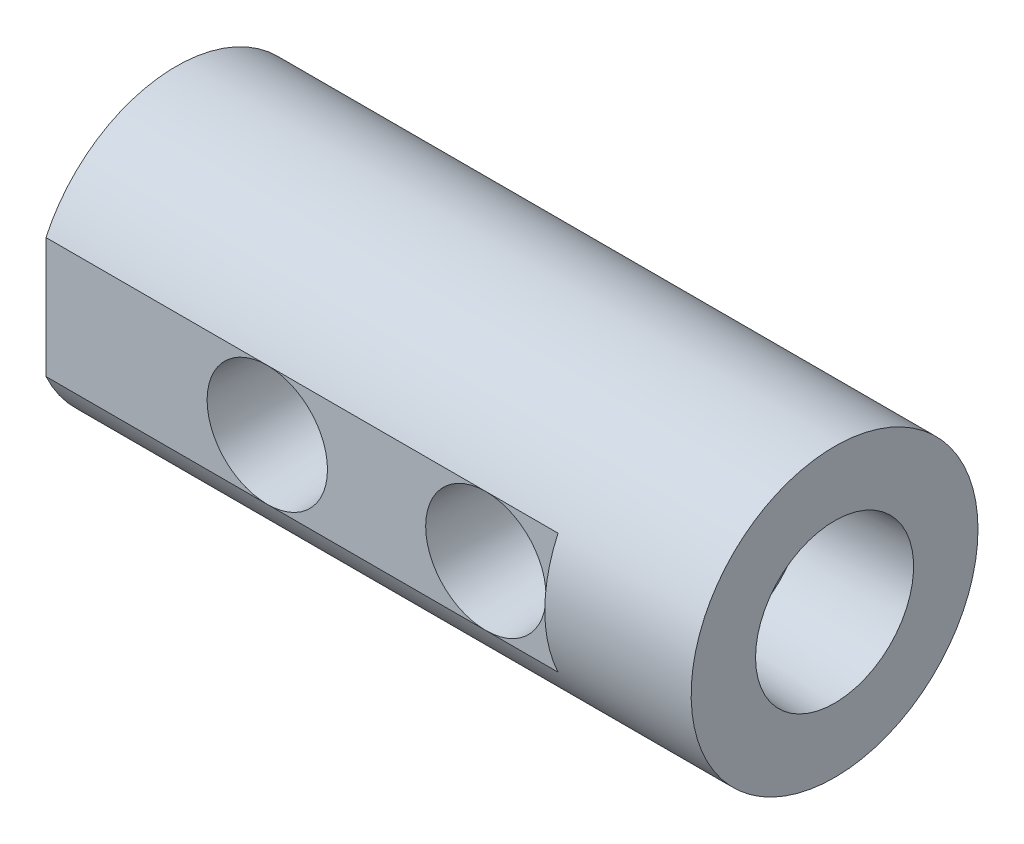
ISO-10303-21;
HEADER;
FILE_DESCRIPTION(('STEP AP214'),'2;1');
FILE_NAME('part.step','',(''),(''),'','','');
FILE_SCHEMA(('AUTOMOTIVE_DESIGN { 1 0 10303 214 1 1 1 1 }'));
ENDSEC;
DATA;
#1=APPLICATION_CONTEXT('core data for automotive mechanical design processes');
#2=APPLICATION_PROTOCOL_DEFINITION('international standard','automotive_design',2000,#1);
#3=PRODUCT_CONTEXT('',#1,'mechanical');
#4=PRODUCT('Part','Part','',(#3));
#5=PRODUCT_RELATED_PRODUCT_CATEGORY('part','',(#4));
#6=PRODUCT_DEFINITION_FORMATION('','',#4);
#7=PRODUCT_DEFINITION_CONTEXT('part definition',#1,'design');
#8=PRODUCT_DEFINITION('design','',#6,#7);
#9=PRODUCT_DEFINITION_SHAPE('','',#8);
#10=(LENGTH_UNIT() NAMED_UNIT(*) SI_UNIT(.MILLI.,.METRE.));
#11=(NAMED_UNIT(*) PLANE_ANGLE_UNIT() SI_UNIT($,.RADIAN.));
#12=(NAMED_UNIT(*) SI_UNIT($,.STERADIAN.) SOLID_ANGLE_UNIT());
#13=UNCERTAINTY_MEASURE_WITH_UNIT(LENGTH_MEASURE(1.E-05),#10,'distance_accuracy_value','');
#14=(GEOMETRIC_REPRESENTATION_CONTEXT(3) GLOBAL_UNCERTAINTY_ASSIGNED_CONTEXT((#13)) GLOBAL_UNIT_ASSIGNED_CONTEXT((#10,
#11,#12)) REPRESENTATION_CONTEXT('',''));
#15=CARTESIAN_POINT('',(0.,0.,0.));
#16=DIRECTION('',(0.,0.,1.));
#17=DIRECTION('',(1.,0.,0.));
#18=AXIS2_PLACEMENT_3D('',#15,#16,#17);
#19=CARTESIAN_POINT('',(35.9156,0.,9.3345));
#20=DIRECTION('',(-1.,0.,0.));
#21=DIRECTION('',(0.,0.,-1.));
#22=AXIS2_PLACEMENT_3D('',#19,#20,#21);
#23=CYLINDRICAL_SURFACE('',#22,2.77749);
#24=CARTESIAN_POINT('',(24.988904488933,0.,9.3345));
#25=DIRECTION('',(1.,0.,0.));
#26=DIRECTION('',(0.,0.,-1.));
#27=AXIS2_PLACEMENT_3D('',#24,#25,#26);
#28=CIRCLE('',#27,2.77749);
#29=CARTESIAN_POINT('',(24.988904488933,0.,6.55701));
#30=VERTEX_POINT('',#29);
#31=EDGE_CURVE('E11',#30,#30,#28,.T.);
#32=ORIENTED_EDGE('',*,*,#31,.T.);
#33=EDGE_LOOP('',(#32));
#34=FACE_BOUND('',#33,.T.);
#35=CARTESIAN_POINT('',(17.9578,-0.648964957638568,12.0351101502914));
#36=CARTESIAN_POINT('',(17.9630136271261,-0.62227062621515,12.0415252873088));
#37=CARTESIAN_POINT('',(17.9679191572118,-0.595423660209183,12.0475576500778));
#38=CARTESIAN_POINT('',(17.9770726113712,-0.541622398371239,12.0588065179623));
#39=CARTESIAN_POINT('',(17.9813243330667,-0.514669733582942,12.0640277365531));
#40=CARTESIAN_POINT('',(17.9891702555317,-0.460681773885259,12.0736551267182));
#41=CARTESIAN_POINT('',(17.9927679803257,-0.43364777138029,12.0780656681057));
#42=CARTESIAN_POINT('',(17.9993062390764,-0.379522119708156,12.0860737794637));
#43=CARTESIAN_POINT('',(18.0022500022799,-0.352431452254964,12.0896753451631));
#44=CARTESIAN_POINT('',(18.007480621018,-0.298217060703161,12.0960681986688));
#45=CARTESIAN_POINT('',(18.0097703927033,-0.27109404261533,12.0988630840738));
#46=CARTESIAN_POINT('',(18.0136933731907,-0.21683930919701,12.1036460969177));
#47=CARTESIAN_POINT('',(18.015329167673,-0.189708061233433,12.1056374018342));
#48=CARTESIAN_POINT('',(18.0179444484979,-0.135460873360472,12.1088173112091));
#49=CARTESIAN_POINT('',(18.0189261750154,-0.108345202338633,12.1100086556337));
#50=CARTESIAN_POINT('',(18.0202339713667,-0.0541530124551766,12.1115940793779));
#51=CARTESIAN_POINT('',(18.020561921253,-0.027076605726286,12.1119904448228));
#52=CARTESIAN_POINT('',(18.0205616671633,0.,12.11199));
#53=B_SPLINE_CURVE_WITH_KNOTS('',3,(#35,#36,#37,#38,#39,#40,#41,#42,#43,#44,#45,#46,#47,#48,#49,
#50,#51,#52),.UNSPECIFIED.,.F.,.F.,(4,2,2,2,2,2,2,2,4),(0.,0.0838309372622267,0.16715488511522,
0.250015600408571,0.332457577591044,0.414525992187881,0.496266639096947,0.577725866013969,
0.658950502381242),.UNSPECIFIED.);
#54=CARTESIAN_POINT('',(17.9578,-0.648964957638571,12.0351101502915));
#55=VERTEX_POINT('',#54);
#56=CARTESIAN_POINT('',(18.0205616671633,0.,12.11199));
#57=VERTEX_POINT('',#56);
#58=EDGE_CURVE('E28',#55,#57,#53,.T.);
#59=ORIENTED_EDGE('',*,*,#58,.T.);
#60=CARTESIAN_POINT('',(18.0205616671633,0.,12.11199));
#61=CARTESIAN_POINT('',(18.020561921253,0.027076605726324,12.1119904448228));
#62=CARTESIAN_POINT('',(18.0202339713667,0.0541530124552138,12.1115940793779));
#63=CARTESIAN_POINT('',(18.0189261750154,0.108345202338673,12.1100086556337));
#64=CARTESIAN_POINT('',(18.0179444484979,0.135460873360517,12.1088173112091));
#65=CARTESIAN_POINT('',(18.015329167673,0.189708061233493,12.1056374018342));
#66=CARTESIAN_POINT('',(18.0136933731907,0.216839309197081,12.1036460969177));
#67=CARTESIAN_POINT('',(18.0097703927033,0.271094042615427,12.0988630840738));
#68=CARTESIAN_POINT('',(18.007480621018,0.298217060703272,12.0960681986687));
#69=CARTESIAN_POINT('',(18.0022500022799,0.352431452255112,12.0896753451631));
#70=CARTESIAN_POINT('',(17.9993062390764,0.379522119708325,12.0860737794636));
#71=CARTESIAN_POINT('',(17.9927679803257,0.433647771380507,12.0780656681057));
#72=CARTESIAN_POINT('',(17.9891702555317,0.460681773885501,12.0736551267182));
#73=CARTESIAN_POINT('',(17.9813243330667,0.514669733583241,12.0640277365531));
#74=CARTESIAN_POINT('',(17.9770726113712,0.541622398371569,12.0588065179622));
#75=CARTESIAN_POINT('',(17.9679191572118,0.59542366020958,12.0475576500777));
#76=CARTESIAN_POINT('',(17.9630136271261,0.622270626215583,12.0415252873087));
#77=CARTESIAN_POINT('',(17.9578,0.648964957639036,12.0351101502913));
#78=B_SPLINE_CURVE_WITH_KNOTS('',3,(#60,#61,#62,#63,#64,#65,#66,#67,#68,#69,#70,#71,#72,#73,#74,
#75,#76,#77),.UNSPECIFIED.,.F.,.F.,(4,2,2,2,2,2,2,2,4),(0.,0.0812246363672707,0.162683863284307,
0.244424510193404,0.326492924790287,0.408934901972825,0.491795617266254,0.575119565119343,
0.658950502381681),.UNSPECIFIED.);
#79=CARTESIAN_POINT('',(17.9578,0.64896495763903,12.0351101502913));
#80=VERTEX_POINT('',#79);
#81=EDGE_CURVE('E260',#57,#80,#78,.T.);
#82=ORIENTED_EDGE('',*,*,#81,.T.);
#83=CARTESIAN_POINT('',(17.9578,0.,9.3345));
#84=DIRECTION('',(1.,0.,0.));
#85=DIRECTION('',(0.,0.,-1.));
#86=AXIS2_PLACEMENT_3D('',#83,#84,#85);
#87=CIRCLE('',#86,2.77749);
#88=EDGE_CURVE('E286',#55,#80,#87,.T.);
#89=ORIENTED_EDGE('',*,*,#88,.F.);
#90=EDGE_LOOP('',(#59,#82,#89));
#91=FACE_BOUND('',#90,.T.);
#92=ADVANCED_FACE('F16',(#34,#91),#23,.F.);
#93=CARTESIAN_POINT('',(25.9715,0.,9.3345));
#94=DIRECTION('',(1.,0.,0.));
#95=DIRECTION('',(0.,0.,-1.));
#96=AXIS2_PLACEMENT_3D('',#93,#94,#95);
#97=CONICAL_SURFACE('',#96,3.175,0.0523598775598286);
#98=CARTESIAN_POINT('',(24.988904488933,0.,9.3345));
#99=DIRECTION('',(1.,0.,0.));
#100=DIRECTION('',(0.,0.,-1.));
#101=AXIS2_PLACEMENT_3D('',#98,#99,#100);
#102=CIRCLE('',#101,3.12350435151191);
#103=CARTESIAN_POINT('',(24.988904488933,0.,12.4580043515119));
#104=VERTEX_POINT('',#103);
#105=EDGE_CURVE('E402',#104,#104,#102,.T.);
#106=ORIENTED_EDGE('',*,*,#105,.F.);
#107=CARTESIAN_POINT('',(25.6233471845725,-1.98927251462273,11.7856));
#108=CARTESIAN_POINT('',(25.5768449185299,-1.92382759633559,11.8355753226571));
#109=CARTESIAN_POINT('',(25.5322171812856,-1.85615531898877,11.8833468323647));
#110=CARTESIAN_POINT('',(25.4469807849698,-1.71612760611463,11.9743292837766));
#111=CARTESIAN_POINT('',(25.4063711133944,-1.6437730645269,12.01754086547));
#112=CARTESIAN_POINT('',(25.329519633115,-1.49404574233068,12.099134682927));
#113=CARTESIAN_POINT('',(25.2932763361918,-1.41667447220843,12.1375182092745));
#114=CARTESIAN_POINT('',(25.2425364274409,-1.29649558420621,12.1911617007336));
#115=CARTESIAN_POINT('',(25.2262283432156,-1.25574770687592,12.2083863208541));
#116=CARTESIAN_POINT('',(25.2027294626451,-1.1935349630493,12.2331862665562));
#117=CARTESIAN_POINT('',(25.1950545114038,-1.17260605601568,12.2412827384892));
#118=CARTESIAN_POINT('',(25.1801166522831,-1.13060718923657,12.2570350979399));
#119=CARTESIAN_POINT('',(25.1728430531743,-1.10950968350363,12.264702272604));
#120=CARTESIAN_POINT('',(25.1374595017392,-1.0035285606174,12.301987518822));
#121=CARTESIAN_POINT('',(25.1122976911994,-0.917166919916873,12.3284598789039));
#122=CARTESIAN_POINT('',(25.0685433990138,-0.741164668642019,12.3744533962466));
#123=CARTESIAN_POINT('',(25.0499496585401,-0.65152465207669,12.3939757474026));
#124=CARTESIAN_POINT('',(25.0273077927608,-0.514452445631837,12.417736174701));
#125=CARTESIAN_POINT('',(25.0206365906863,-0.468325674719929,12.4247343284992));
#126=CARTESIAN_POINT('',(25.0119978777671,-0.398455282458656,12.433794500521));
#127=CARTESIAN_POINT('',(25.0093426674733,-0.375011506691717,12.4365788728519));
#128=CARTESIAN_POINT('',(25.0045250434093,-0.328161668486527,12.4416303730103));
#129=CARTESIAN_POINT('',(25.0023602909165,-0.304744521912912,12.4438999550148));
#130=CARTESIAN_POINT('',(24.992747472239,-0.187697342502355,12.4539775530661));
#131=CARTESIAN_POINT('',(24.9889260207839,-0.0941827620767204,12.4579817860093));
#132=CARTESIAN_POINT('',(24.9889045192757,-0.0005260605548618,12.4580043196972));
#133=CARTESIAN_POINT('',(24.9889044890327,-0.0002630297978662,12.4580043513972));
#134=CARTESIAN_POINT('',(24.988904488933,0.,12.4580043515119));
#135=(BOUNDED_CURVE() B_SPLINE_CURVE(3,(#107,#108,#109,#110,#111,#112,#113,#114,#115,#116,#117,
#118,#119,#120,#121,#122,#123,#124,#125,#126,#127,#128,#129,#130,#131,#132,#133,#134),
.UNSPECIFIED.,.F.,.F.) B_SPLINE_CURVE_WITH_KNOTS((4,2,2,2,2,2,2,2,2,2,2,2,2,4),(0.,
0.062500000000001,0.125000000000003,0.187500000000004,0.218750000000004,0.234375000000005,
0.250000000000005,0.312500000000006,0.375000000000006,0.406250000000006,0.421875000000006,
0.437500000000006,0.500000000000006,0.500176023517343),
.UNSPECIFIED.) CURVE() GEOMETRIC_REPRESENTATION_ITEM() RATIONAL_B_SPLINE_CURVE((1.,1.,1.,1.,1.,
1.,1.,1.,1.,1.,1.,1.,1.,1.,1.,1.,1.,1.,1.,1.,1.,1.,1.,1.,1.,1.,1.,1.)) REPRESENTATION_ITEM(''));
#136=CARTESIAN_POINT('',(25.6233471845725,-1.98927251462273,11.7856));
#137=VERTEX_POINT('',#136);
#138=EDGE_CURVE('E425',#137,#104,#135,.T.);
#139=ORIENTED_EDGE('',*,*,#138,.F.);
#140=CARTESIAN_POINT('',(25.9715,-2.01810153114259,11.7856));
#141=CARTESIAN_POINT('',(25.8554458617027,-2.00853273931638,11.7856));
#142=CARTESIAN_POINT('',(25.7393948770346,-1.99892365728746,11.7856));
#143=CARTESIAN_POINT('',(25.6233471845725,-1.98927251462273,11.7856));
#144=(BOUNDED_CURVE() B_SPLINE_CURVE(3,(#140,#141,#142,#143),.UNSPECIFIED.,.F.,
.F.) B_SPLINE_CURVE_WITH_KNOTS((4,4),(0.,1.),
.UNSPECIFIED.) CURVE() GEOMETRIC_REPRESENTATION_ITEM() RATIONAL_B_SPLINE_CURVE((1.,1.,1.,1.)) REPRESENTATION_ITEM(''));
#145=CARTESIAN_POINT('',(25.9715,-2.01810153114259,11.7856));
#146=VERTEX_POINT('',#145);
#147=EDGE_CURVE('E326',#146,#137,#144,.T.);
#148=ORIENTED_EDGE('',*,*,#147,.F.);
#149=CARTESIAN_POINT('',(25.9715,0.,9.3345));
#150=DIRECTION('',(-1.,0.,0.));
#151=DIRECTION('',(0.,0.,1.));
#152=AXIS2_PLACEMENT_3D('',#149,#150,#151);
#153=CIRCLE('',#152,3.175);
#154=CARTESIAN_POINT('',(25.9715,0.,6.1595));
#155=VERTEX_POINT('',#154);
#156=EDGE_CURVE('E434',#155,#146,#153,.T.);
#157=ORIENTED_EDGE('',*,*,#156,.F.);
#158=CARTESIAN_POINT('',(25.9715,0.,9.3345));
#159=DIRECTION('',(-1.,0.,0.));
#160=DIRECTION('',(0.,0.,1.));
#161=AXIS2_PLACEMENT_3D('',#158,#159,#160);
#162=CIRCLE('',#161,3.175);
#163=CARTESIAN_POINT('',(25.9715,2.01810153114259,11.7856));
#164=VERTEX_POINT('',#163);
#165=EDGE_CURVE('E439',#164,#155,#162,.T.);
#166=ORIENTED_EDGE('',*,*,#165,.F.);
#167=CARTESIAN_POINT('',(25.6233471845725,1.98927251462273,11.7856));
#168=CARTESIAN_POINT('',(25.7393948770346,1.99892365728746,11.7856));
#169=CARTESIAN_POINT('',(25.8554458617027,2.00853273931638,11.7856));
#170=CARTESIAN_POINT('',(25.9715,2.01810153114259,11.7856));
#171=(BOUNDED_CURVE() B_SPLINE_CURVE(3,(#167,#168,#169,#170),.UNSPECIFIED.,.F.,
.F.) B_SPLINE_CURVE_WITH_KNOTS((4,4),(0.,1.),
.UNSPECIFIED.) CURVE() GEOMETRIC_REPRESENTATION_ITEM() RATIONAL_B_SPLINE_CURVE((1.,1.,1.,1.)) REPRESENTATION_ITEM(''));
#172=CARTESIAN_POINT('',(25.6233471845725,1.98927251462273,11.7856));
#173=VERTEX_POINT('',#172);
#174=EDGE_CURVE('E327',#173,#164,#171,.T.);
#175=ORIENTED_EDGE('',*,*,#174,.F.);
#176=CARTESIAN_POINT('',(24.988904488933,0.,12.4580043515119));
#177=CARTESIAN_POINT('',(24.9889044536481,0.093129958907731,12.4580043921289));
#178=CARTESIAN_POINT('',(24.9926832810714,0.18613967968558,12.4540448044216));
#179=CARTESIAN_POINT('',(25.0040426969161,0.325604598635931,12.4421362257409));
#180=CARTESIAN_POINT('',(25.0087895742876,0.372150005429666,12.4371592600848));
#181=CARTESIAN_POINT('',(25.0173521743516,0.441922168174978,12.428179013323));
#182=CARTESIAN_POINT('',(25.0204495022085,0.465190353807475,12.4249302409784));
#183=CARTESIAN_POINT('',(25.0271165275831,0.511631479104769,12.4179361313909));
#184=CARTESIAN_POINT('',(25.0306750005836,0.534729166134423,12.4142025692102));
#185=CARTESIAN_POINT('',(25.0495675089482,0.649616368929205,12.3943769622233));
#186=CARTESIAN_POINT('',(25.0681944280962,0.73960645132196,12.3748199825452));
#187=CARTESIAN_POINT('',(25.111972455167,0.916010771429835,12.3288019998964));
#188=CARTESIAN_POINT('',(25.1371251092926,1.00242419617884,12.3023394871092));
#189=CARTESIAN_POINT('',(25.179496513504,1.12948851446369,12.2576914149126));
#190=CARTESIAN_POINT('',(25.1943951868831,1.17141666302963,12.2419816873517));
#191=CARTESIAN_POINT('',(25.2178831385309,1.2336794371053,12.2171937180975));
#192=CARTESIAN_POINT('',(25.2259018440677,1.25432505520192,12.2087277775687));
#193=CARTESIAN_POINT('',(25.2422315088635,1.29520363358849,12.191479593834));
#194=CARTESIAN_POINT('',(25.2505522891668,1.31546307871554,12.1826869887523));
#195=CARTESIAN_POINT('',(25.2929132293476,1.41588539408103,12.1379026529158));
#196=CARTESIAN_POINT('',(25.3292186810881,1.49343054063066,12.0994537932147));
#197=CARTESIAN_POINT('',(25.4061835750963,1.64343637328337,12.0177403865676));
#198=CARTESIAN_POINT('',(25.4468445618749,1.71589545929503,11.9744744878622));
#199=CARTESIAN_POINT('',(25.5321647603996,1.85607754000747,11.8834029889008));
#200=CARTESIAN_POINT('',(25.5768250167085,1.92379958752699,11.8355967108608));
#201=CARTESIAN_POINT('',(25.6233471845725,1.98927251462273,11.7856));
#202=(BOUNDED_CURVE() B_SPLINE_CURVE(3,(#176,#177,#178,#179,#180,#181,#182,#183,#184,#185,#186,
#187,#188,#189,#190,#191,#192,#193,#194,#195,#196,#197,#198,#199,#200,#201),.UNSPECIFIED.,.F.,
.F.) B_SPLINE_CURVE_WITH_KNOTS((4,2,2,2,2,2,2,2,2,2,2,2,4),(0.500176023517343,0.5625,0.59375,
0.609375,0.625,0.6875,0.750000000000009,0.781250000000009,0.796875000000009,0.812500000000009,
0.875,0.9375,1.),
.UNSPECIFIED.) CURVE() GEOMETRIC_REPRESENTATION_ITEM() RATIONAL_B_SPLINE_CURVE((1.,1.,1.,1.,1.,
1.,1.,1.,1.,1.,1.,1.,1.,1.,1.,1.,1.,1.,1.,1.,1.,1.,1.,1.,1.,1.)) REPRESENTATION_ITEM(''));
#203=EDGE_CURVE('E452',#104,#173,#202,.T.);
#204=ORIENTED_EDGE('',*,*,#203,.F.);
#205=EDGE_LOOP('',(#106,#139,#148,#157,#166,#175,#204));
#206=FACE_BOUND('',#205,.T.);
#207=ADVANCED_FACE('F221',(#206),#97,.F.);
#208=CARTESIAN_POINT('',(18.0034562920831,0.,11.7856));
#209=DIRECTION('',(0.,0.,1.));
#210=DIRECTION('',(1.,0.,0.));
#211=AXIS2_PLACEMENT_3D('',#208,#209,#210);
#212=PLANE('',#211);
#213=CARTESIAN_POINT('',(14.4018,0.,11.7856));
#214=DIRECTION('',(0.,0.,-1.));
#215=DIRECTION('',(-1.,0.,0.));
#216=AXIS2_PLACEMENT_3D('',#213,#214,#215);
#217=CIRCLE('',#216,2.6543);
#218=CARTESIAN_POINT('',(11.7475,0.,11.7856));
#219=VERTEX_POINT('',#218);
#220=EDGE_CURVE('E353',#219,#219,#217,.T.);
#221=ORIENTED_EDGE('',*,*,#220,.T.);
#222=EDGE_LOOP('',(#221));
#223=FACE_BOUND('',#222,.T.);
#224=CARTESIAN_POINT('',(14.4018,0.,11.7856));
#225=DIRECTION('',(0.,0.,-1.));
#226=DIRECTION('',(-1.,0.,0.));
#227=AXIS2_PLACEMENT_3D('',#224,#225,#226);
#228=CIRCLE('',#227,3.60165629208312);
#229=CARTESIAN_POINT('',(17.9578,-0.571657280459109,11.7856));
#230=VERTEX_POINT('',#229);
#231=CARTESIAN_POINT('',(17.9578,0.571657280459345,11.7856000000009));
#232=VERTEX_POINT('',#231);
#233=EDGE_CURVE('E354',#230,#232,#228,.T.);
#234=ORIENTED_EDGE('',*,*,#233,.F.);
#235=DIRECTION('',(0.,1.,0.));
#236=VECTOR('',#235,1.);
#237=CARTESIAN_POINT('',(17.9578,0.,11.7856));
#238=LINE('',#237,#236);
#239=EDGE_CURVE('E350',#230,#232,#238,.T.);
#240=ORIENTED_EDGE('',*,*,#239,.T.);
#241=EDGE_LOOP('',(#234,#240));
#242=FACE_BOUND('',#241,.T.);
#243=ADVANCED_FACE('F228',(#223,#242),#212,.T.);
#244=CARTESIAN_POINT('',(14.4018,0.,18.669));
#245=DIRECTION('',(0.,0.,1.));
#246=DIRECTION('',(1.,0.,0.));
#247=AXIS2_PLACEMENT_3D('',#244,#245,#246);
#248=CONICAL_SURFACE('',#247,3.9624,0.0523598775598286);
#249=CARTESIAN_POINT('',(14.4018,0.,17.8072872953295));
#250=DIRECTION('',(0.,0.,-1.));
#251=DIRECTION('',(0.,1.,0.));
#252=AXIS2_PLACEMENT_3D('',#249,#250,#251);
#253=CIRCLE('',#252,3.91723955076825);
#254=CARTESIAN_POINT('',(14.4018,3.91723955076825,17.8072872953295));
#255=VERTEX_POINT('',#254);
#256=CARTESIAN_POINT('',(14.4018,-3.91723955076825,17.8072872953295));
#257=VERTEX_POINT('',#256);
#258=EDGE_CURVE('E359',#255,#257,#253,.T.);
#259=ORIENTED_EDGE('',*,*,#258,.F.);
#260=CARTESIAN_POINT('',(14.4018,0.,17.8072872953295));
#261=DIRECTION('',(0.,0.,-1.));
#262=DIRECTION('',(0.,1.,0.));
#263=AXIS2_PLACEMENT_3D('',#260,#261,#262);
#264=CIRCLE('',#263,3.91723955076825);
#265=EDGE_CURVE('E399',#257,#255,#264,.T.);
#266=ORIENTED_EDGE('',*,*,#265,.F.);
#267=EDGE_LOOP('',(#259,#266));
#268=FACE_BOUND('',#267,.T.);
#269=CARTESIAN_POINT('',(17.9578,0.64896495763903,12.0351101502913));
#270=CARTESIAN_POINT('',(17.9578,0.624540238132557,11.9514383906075));
#271=CARTESIAN_POINT('',(17.9578,0.598933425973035,11.8682077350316));
#272=CARTESIAN_POINT('',(17.9578,0.571657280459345,11.7856000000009));
#273=(BOUNDED_CURVE() B_SPLINE_CURVE(3,(#269,#270,#271,#272),.UNSPECIFIED.,.F.,
.F.) B_SPLINE_CURVE_WITH_KNOTS((4,4),(0.00179944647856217,0.00206056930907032),
.UNSPECIFIED.) CURVE() GEOMETRIC_REPRESENTATION_ITEM() RATIONAL_B_SPLINE_CURVE((1.,1.,1.,1.)) REPRESENTATION_ITEM(''));
#274=EDGE_CURVE('E264',#80,#232,#273,.T.);
#275=ORIENTED_EDGE('',*,*,#274,.F.);
#276=ORIENTED_EDGE('',*,*,#81,.F.);
#277=ORIENTED_EDGE('',*,*,#58,.F.);
#278=CARTESIAN_POINT('',(17.9578,-0.571657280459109,11.7856));
#279=CARTESIAN_POINT('',(17.9578,-0.598995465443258,11.8683956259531));
#280=CARTESIAN_POINT('',(17.9578,-0.62458959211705,11.9516074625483));
#281=CARTESIAN_POINT('',(17.9578,-0.648964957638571,12.0351101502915));
#282=(BOUNDED_CURVE() B_SPLINE_CURVE(3,(#278,#279,#280,#281),.UNSPECIFIED.,.F.,
.F.) B_SPLINE_CURVE_WITH_KNOTS((4,4),(0.00423160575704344,0.00449321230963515),
.UNSPECIFIED.) CURVE() GEOMETRIC_REPRESENTATION_ITEM() RATIONAL_B_SPLINE_CURVE((1.,1.,1.,1.)) REPRESENTATION_ITEM(''));
#283=EDGE_CURVE('E293',#230,#55,#282,.T.);
#284=ORIENTED_EDGE('',*,*,#283,.F.);
#285=ORIENTED_EDGE('',*,*,#233,.T.);
#286=EDGE_LOOP('',(#275,#276,#277,#284,#285));
#287=FACE_BOUND('',#286,.T.);
#288=ADVANCED_FACE('F265',(#268,#287),#248,.F.);
#289=CARTESIAN_POINT('',(46.6400387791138,0.,9.3345));
#290=DIRECTION('',(-1.,0.,0.));
#291=DIRECTION('',(0.,0.,1.));
#292=AXIS2_PLACEMENT_3D('',#289,#290,#291);
#293=CYLINDRICAL_SURFACE('',#292,2.1209);
#294=CARTESIAN_POINT('',(17.9578,0.,9.3345));
#295=DIRECTION('',(-1.,0.,0.));
#296=DIRECTION('',(0.,0.,-1.));
#297=AXIS2_PLACEMENT_3D('',#294,#295,#296);
#298=CIRCLE('',#297,2.1209);
#299=CARTESIAN_POINT('',(17.9578,0.,7.21359994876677));
#300=VERTEX_POINT('',#299);
#301=EDGE_CURVE('E297',#300,#300,#298,.T.);
#302=ORIENTED_EDGE('',*,*,#301,.F.);
#303=EDGE_LOOP('',(#302));
#304=FACE_BOUND('',#303,.T.);
#305=CARTESIAN_POINT('',(17.0561000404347,0.,7.21359992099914));
#306=CARTESIAN_POINT('',(17.0561004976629,0.0692471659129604,7.21359902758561));
#307=CARTESIAN_POINT('',(17.05339450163,0.13863085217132,7.21698286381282));
#308=CARTESIAN_POINT('',(17.0464821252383,0.226503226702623,7.22564887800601));
#309=CARTESIAN_POINT('',(17.0448429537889,0.244891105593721,7.22770473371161));
#310=CARTESIAN_POINT('',(17.0411900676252,0.281545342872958,7.23228921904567));
#311=CARTESIAN_POINT('',(17.0391805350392,0.299776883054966,7.2348125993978));
#312=CARTESIAN_POINT('',(17.0326159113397,0.354190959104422,7.24306227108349));
#313=CARTESIAN_POINT('',(17.0275251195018,0.390093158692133,7.24946753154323));
#314=CARTESIAN_POINT('',(17.0102026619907,0.496719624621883,7.27131036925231));
#315=CARTESIAN_POINT('',(16.9959246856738,0.566366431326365,7.28936747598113));
#316=CARTESIAN_POINT('',(16.9707030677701,0.668791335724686,7.3214885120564));
#317=CARTESIAN_POINT('',(16.9616607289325,0.702591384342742,7.3330367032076));
#318=CARTESIAN_POINT('',(16.9423436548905,0.769519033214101,7.3578031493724));
#319=CARTESIAN_POINT('',(16.9320435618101,0.802713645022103,7.37105439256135));
#320=CARTESIAN_POINT('',(16.8997096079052,0.900249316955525,7.41284130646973));
#321=CARTESIAN_POINT('',(16.8761682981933,0.962859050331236,7.44350103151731));
#322=CARTESIAN_POINT('',(16.8256815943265,1.08369462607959,7.51006019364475));
#323=CARTESIAN_POINT('',(16.7987339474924,1.14191879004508,7.54596092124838));
#324=CARTESIAN_POINT('',(16.7632176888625,1.21213144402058,7.59402771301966));
#325=CARTESIAN_POINT('',(16.7560227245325,1.22604525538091,7.60380112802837));
#326=CARTESIAN_POINT('',(16.7414564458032,1.25361849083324,7.62366797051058));
#327=CARTESIAN_POINT('',(16.7340786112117,1.26728968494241,7.63377037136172));
#328=CARTESIAN_POINT('',(16.7117375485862,1.30784162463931,7.66449475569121));
#329=CARTESIAN_POINT('',(16.6966038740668,1.33419635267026,7.68548230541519));
#330=CARTESIAN_POINT('',(16.6505896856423,1.41132504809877,7.7499280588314));
#331=CARTESIAN_POINT('',(16.6190955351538,1.46016934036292,7.79486335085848));
#332=CARTESIAN_POINT('',(16.5550221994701,1.55310275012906,7.88866205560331));
#333=CARTESIAN_POINT('',(16.522440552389,1.59719087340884,7.93752478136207));
#334=CARTESIAN_POINT('',(16.4731968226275,1.65991877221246,8.01390472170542));
#335=CARTESIAN_POINT('',(16.4567209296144,1.68025941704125,8.03988063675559));
#336=CARTESIAN_POINT('',(16.4319788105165,1.70992640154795,8.07965257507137));
#337=CARTESIAN_POINT('',(16.4237180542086,1.71968476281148,8.09305909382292));
#338=CARTESIAN_POINT('',(16.4072459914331,1.73886591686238,8.12007152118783));
#339=CARTESIAN_POINT('',(16.3990382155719,1.74828498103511,8.13367130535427));
#340=CARTESIAN_POINT('',(16.3581704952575,1.79453642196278,8.20214592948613));
#341=CARTESIAN_POINT('',(16.3260162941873,1.82884616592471,8.25843998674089));
#342=CARTESIAN_POINT('',(16.2636635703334,1.89228715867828,8.37437877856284));
#343=CARTESIAN_POINT('',(16.2334608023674,1.92141930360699,8.43402107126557));
#344=CARTESIAN_POINT('',(16.1761437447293,1.97447150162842,8.55721193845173));
#345=CARTESIAN_POINT('',(16.1490231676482,1.99839491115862,8.62075594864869));
#346=CARTESIAN_POINT('',(16.111821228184,2.03012352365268,8.71967133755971));
#347=CARTESIAN_POINT('',(16.1000042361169,2.04000437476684,8.75324607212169));
#348=CARTESIAN_POINT('',(16.0833438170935,2.05372116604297,8.8046316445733));
#349=CARTESIAN_POINT('',(16.0779635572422,2.05811274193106,8.82195002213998));
#350=CARTESIAN_POINT('',(16.0676748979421,2.0664494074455,8.85666908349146));
#351=CARTESIAN_POINT('',(16.0627559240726,2.07040329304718,8.87410076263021));
#352=CARTESIAN_POINT('',(16.0393497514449,2.08909394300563,8.96163218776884));
#353=CARTESIAN_POINT('',(16.0244284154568,2.10060801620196,9.03284901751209));
#354=CARTESIAN_POINT('',(16.0089601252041,2.11243625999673,9.14172424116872));
#355=CARTESIAN_POINT('',(16.0049564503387,2.11546916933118,9.17835805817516));
#356=CARTESIAN_POINT('',(16.0015133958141,2.11807136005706,9.22460752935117));
#357=CARTESIAN_POINT('',(16.0009028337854,2.11853228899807,9.23388028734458));
#358=CARTESIAN_POINT('',(15.9998407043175,2.11933358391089,9.25247228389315));
#359=CARTESIAN_POINT('',(15.9993888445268,2.11967417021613,9.26180206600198));
#360=CARTESIAN_POINT('',(15.9982803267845,2.12050935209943,9.28973430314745));
#361=CARTESIAN_POINT('',(15.9978684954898,2.12081914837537,9.30830666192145));
#362=CARTESIAN_POINT('',(15.9974234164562,2.12115407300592,9.40092639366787));
#363=CARTESIAN_POINT('',(16.0022505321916,2.11754849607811,9.47424669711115));
#364=CARTESIAN_POINT('',(16.0166130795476,2.10659048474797,9.58314498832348));
#365=CARTESIAN_POINT('',(16.0225838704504,2.10201059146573,9.61926424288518));
#366=CARTESIAN_POINT('',(16.0332067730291,2.09376229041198,9.67318403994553));
#367=CARTESIAN_POINT('',(16.0370253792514,2.09078297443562,9.69111412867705));
#368=CARTESIAN_POINT('',(16.043155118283,2.08596946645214,9.71794590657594));
#369=CARTESIAN_POINT('',(16.0452655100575,2.08430737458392,9.72687922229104));
#370=CARTESIAN_POINT('',(16.0495985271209,2.08088349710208,9.74464943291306));
#371=CARTESIAN_POINT('',(16.0518233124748,2.0791200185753,9.75349600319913));
#372=CARTESIAN_POINT('',(16.0723506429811,2.06279243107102,9.8327783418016));
#373=CARTESIAN_POINT('',(16.0941603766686,2.04505426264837,9.90087148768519));
#374=CARTESIAN_POINT('',(16.1429262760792,2.00369904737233,10.0332229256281));
#375=CARTESIAN_POINT('',(16.1698868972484,1.98007744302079,10.0974780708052));
#376=CARTESIAN_POINT('',(16.2130633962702,1.94036485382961,10.1914465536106));
#377=CARTESIAN_POINT('',(16.2279177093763,1.92640851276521,10.2223708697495));
#378=CARTESIAN_POINT('',(16.2583783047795,1.89706948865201,10.2834424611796));
#379=CARTESIAN_POINT('',(16.2738752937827,1.88179189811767,10.3133723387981));
#380=CARTESIAN_POINT('',(16.3209458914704,1.83417016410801,10.4015035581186));
#381=CARTESIAN_POINT('',(16.3530912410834,1.80004337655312,10.4580558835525));
#382=CARTESIAN_POINT('',(16.4179884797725,1.72704304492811,10.5673245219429));
#383=CARTESIAN_POINT('',(16.4507445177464,1.68816871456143,10.6200377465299));
#384=CARTESIAN_POINT('',(16.5161558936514,1.60548634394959,10.7219200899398));
#385=CARTESIAN_POINT('',(16.5488141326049,1.56167901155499,10.7710879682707));
#386=CARTESIAN_POINT('',(16.5891954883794,1.50359889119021,10.8303886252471));
#387=CARTESIAN_POINT('',(16.597249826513,1.49181630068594,10.8421403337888));
#388=CARTESIAN_POINT('',(16.6133054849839,1.46790984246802,10.865426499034));
#389=CARTESIAN_POINT('',(16.6213171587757,1.45576983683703,10.8769757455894));
#390=CARTESIAN_POINT('',(16.6451698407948,1.41896273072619,10.9111684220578));
#391=CARTESIAN_POINT('',(16.6608227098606,1.39392045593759,10.9333499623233));
#392=CARTESIAN_POINT('',(16.7069449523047,1.31725952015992,10.9980860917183));
#393=CARTESIAN_POINT('',(16.7365783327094,1.26411081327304,11.0388383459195));
#394=CARTESIAN_POINT('',(16.7931494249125,1.15352240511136,11.1155478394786));
#395=CARTESIAN_POINT('',(16.8200891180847,1.09608378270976,11.1515053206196));
#396=CARTESIAN_POINT('',(16.8707757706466,0.976565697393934,11.2184393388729));
#397=CARTESIAN_POINT('',(16.8945251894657,0.914488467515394,11.2494175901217));
#398=CARTESIAN_POINT('',(16.9218438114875,0.833653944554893,11.2847690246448));
#399=CARTESIAN_POINT('',(16.927188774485,0.81732456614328,11.2916700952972));
#400=CARTESIAN_POINT('',(16.9376301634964,0.784329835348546,11.3051245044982));
#401=CARTESIAN_POINT('',(16.9427352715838,0.767634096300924,11.31168896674));
#402=CARTESIAN_POINT('',(16.9575727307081,0.717326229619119,11.3307329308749));
#403=CARTESIAN_POINT('',(16.966839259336,0.683465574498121,11.342578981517));
#404=CARTESIAN_POINT('',(16.9927128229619,0.580905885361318,11.3755593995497));
#405=CARTESIAN_POINT('',(17.0073976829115,0.511231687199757,11.3941436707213));
#406=CARTESIAN_POINT('',(17.0312897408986,0.36916232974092,11.4242868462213));
#407=CARTESIAN_POINT('',(17.0404987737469,0.296767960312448,11.4358475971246));
#408=CARTESIAN_POINT('',(17.0482796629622,0.20444377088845,11.4456049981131));
#409=CARTESIAN_POINT('',(17.0496468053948,0.185905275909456,11.4473184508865));
#410=CARTESIAN_POINT('',(17.051989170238,0.148831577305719,11.4502532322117));
#411=CARTESIAN_POINT('',(17.0539433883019,0.111718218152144,11.4527006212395));
#412=CARTESIAN_POINT('',(17.0551188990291,0.0745253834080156,11.4541720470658));
#413=CARTESIAN_POINT('',(17.0557072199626,0.0466008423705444,11.4549084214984));
#414=CARTESIAN_POINT('',(17.0559280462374,0.0326310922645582,11.4551847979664));
#415=CARTESIAN_POINT('',(17.0560569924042,0.0163199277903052,11.4553461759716));
#416=CARTESIAN_POINT('',(17.056084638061,0.0093266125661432,11.4553807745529));
#417=CARTESIAN_POINT('',(17.0560969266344,0.0046637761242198,11.455396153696));
#418=CARTESIAN_POINT('',(17.0561,0.0023202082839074,11.4554));
#419=CARTESIAN_POINT('',(17.0561,0.,11.4554));
#420=(BOUNDED_CURVE() B_SPLINE_CURVE(3,(#305,#306,#307,#308,#309,#310,#311,#312,#313,#314,#315,
#316,#317,#318,#319,#320,#321,#322,#323,#324,#325,#326,#327,#328,#329,#330,#331,#332,#333,#334,
#335,#336,#337,#338,#339,#340,#341,#342,#343,#344,#345,#346,#347,#348,#349,#350,#351,#352,#353,
#354,#355,#356,#357,#358,#359,#360,#361,#362,#363,#364,#365,#366,#367,#368,#369,#370,#371,#372,
#373,#374,#375,#376,#377,#378,#379,#380,#381,#382,#383,#384,#385,#386,#387,#388,#389,#390,#391,
#392,#393,#394,#395,#396,#397,#398,#399,#400,#401,#402,#403,#404,#405,#406,#407,#408,#409,#410,
#411,#412,#413,#414,#415,#416,#417,#418,#419),.UNSPECIFIED.,.F.,
.F.) B_SPLINE_CURVE_WITH_KNOTS((4,2,2,2,2,2,2,2,2,2,2,2,2,2,2,2,2,2,2,2,2,2,2,2,2,2,2,2,2,2,2,2,
2,2,2,2,2,2,2,2,2,2,2,2,2,2,2,2,2,2,2,2,2,1,2,1,1,2,4),(0.50082431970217,0.515625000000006,
0.519531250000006,0.5234375,0.53125,0.546875,0.5546875,0.5625,0.578125,0.59375,
0.597656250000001,0.6015625,0.609375,0.625,0.640625,0.6484375,0.652343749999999,0.65625,
0.671875,0.6875,0.703125,0.7109375,0.714843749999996,0.71875,0.734375,0.7421875,
0.744140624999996,0.746093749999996,0.75,0.765625,0.7734375,0.777343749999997,0.779296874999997,
0.78125,0.796875,0.8125,0.8203125,0.828125,0.84375,0.859375,0.875,0.878906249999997,0.8828125,
0.890625,0.90625,0.921875,0.9375,0.941406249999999,0.9453125,0.953125,0.96875,0.984375,
0.98828125,0.9921875,0.99609375,0.998046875,0.9990234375,0.99951171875,1.),
.UNSPECIFIED.) CURVE() GEOMETRIC_REPRESENTATION_ITEM() RATIONAL_B_SPLINE_CURVE((1.,1.,1.,1.,1.,
1.,1.,1.,1.,1.,1.,1.,1.,1.,1.,1.,1.,1.,1.,1.,1.,1.,1.,1.,1.,1.,1.,1.,1.,1.,1.,1.,1.,1.,1.,1.,1.,
1.,1.,1.,1.,1.,1.,1.,1.,1.,1.,1.,1.,1.,1.,1.,1.,1.,1.,1.,1.,1.,1.,1.,1.,1.,1.,1.,1.,1.,1.,1.,1.,
1.,1.,1.,1.,1.,1.,1.,1.,1.,1.,1.,1.,1.,1.,1.,1.,1.,1.,1.,1.,1.,1.,1.,1.,1.,1.,1.,1.,1.,1.,1.,1.,
1.,1.,1.,1.,1.,1.,1.,1.,1.,1.,1.,1.,1.,1.)) REPRESENTATION_ITEM(''));
#421=CARTESIAN_POINT('',(17.0561000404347,0.,7.21359992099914));
#422=VERTEX_POINT('',#421);
#423=CARTESIAN_POINT('',(17.0561,0.,11.4554));
#424=VERTEX_POINT('',#423);
#425=EDGE_CURVE('E458',#422,#424,#420,.T.);
#426=ORIENTED_EDGE('',*,*,#425,.F.);
#427=CARTESIAN_POINT('',(17.0561,0.,11.4554));
#428=CARTESIAN_POINT('',(17.0561,-0.0742466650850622,11.4554));
#429=CARTESIAN_POINT('',(17.052991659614,-0.147578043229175,11.4515135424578));
#430=CARTESIAN_POINT('',(17.0409346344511,-0.292514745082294,11.436394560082));
#431=CARTESIAN_POINT('',(17.0319846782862,-0.364119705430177,11.4251605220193));
#432=CARTESIAN_POINT('',(17.0143544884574,-0.470270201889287,11.4029220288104));
#433=CARTESIAN_POINT('',(17.0077759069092,-0.505443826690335,11.3946094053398));
#434=CARTESIAN_POINT('',(16.996869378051,-0.557890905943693,11.380789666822));
#435=CARTESIAN_POINT('',(16.9930607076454,-0.57532101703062,11.3759578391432));
#436=CARTESIAN_POINT('',(16.985098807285,-0.610076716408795,11.3658421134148));
#437=CARTESIAN_POINT('',(16.9809570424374,-0.627350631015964,11.3605727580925));
#438=CARTESIAN_POINT('',(16.9595349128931,-0.712939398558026,11.333274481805));
#439=CARTESIAN_POINT('',(16.9400570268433,-0.779198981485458,11.3083208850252));
#440=CARTESIAN_POINT('',(16.8969939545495,-0.907693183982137,11.2526274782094));
#441=CARTESIAN_POINT('',(16.8734065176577,-0.969926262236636,11.221885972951));
#442=CARTESIAN_POINT('',(16.8352840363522,-1.06044129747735,11.1715826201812));
#443=CARTESIAN_POINT('',(16.8221189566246,-1.09013952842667,11.1541145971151));
#444=CARTESIAN_POINT('',(16.8017231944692,-1.1339916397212,11.126866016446));
#445=CARTESIAN_POINT('',(16.7948288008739,-1.14846608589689,11.1176249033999));
#446=CARTESIAN_POINT('',(16.7809012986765,-1.17704638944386,11.0988895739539));
#447=CARTESIAN_POINT('',(16.7738616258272,-1.19116641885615,11.0893865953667));
#448=CARTESIAN_POINT('',(16.7383064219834,-1.26094056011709,11.0412065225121));
#449=CARTESIAN_POINT('',(16.7087223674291,-1.31412513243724,11.0005418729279));
#450=CARTESIAN_POINT('',(16.6478156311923,-1.41570811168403,10.9151299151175));
#451=CARTESIAN_POINT('',(16.6164907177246,-1.46410488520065,10.8703823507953));
#452=CARTESIAN_POINT('',(16.5526263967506,-1.55640736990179,10.7767668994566));
#453=CARTESIAN_POINT('',(16.5200845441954,-1.60031257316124,10.727900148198));
#454=CARTESIAN_POINT('',(16.4790106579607,-1.65247714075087,10.6640893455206));
#455=CARTESIAN_POINT('',(16.470776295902,-1.66277384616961,10.6511902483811));
#456=CARTESIAN_POINT('',(16.4542787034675,-1.68309564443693,10.6251119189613));
#457=CARTESIAN_POINT('',(16.4460330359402,-1.69309893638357,10.6119602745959));
#458=CARTESIAN_POINT('',(16.4213677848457,-1.72258855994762,10.5722371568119));
#459=CARTESIAN_POINT('',(16.4050003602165,-1.74157890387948,10.5453673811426));
#460=CARTESIAN_POINT('',(16.3562657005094,-1.79660051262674,10.4635543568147));
#461=CARTESIAN_POINT('',(16.324258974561,-1.83068918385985,10.407414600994));
#462=CARTESIAN_POINT('',(16.2620905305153,-1.89382959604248,10.291567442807));
#463=CARTESIAN_POINT('',(16.2319240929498,-1.9228827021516,10.2318631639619));
#464=CARTESIAN_POINT('',(16.1745904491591,-1.97586591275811,10.1082521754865));
#465=CARTESIAN_POINT('',(16.1474158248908,-1.99980016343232,10.0443514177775));
#466=CARTESIAN_POINT('',(16.1163298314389,-2.02626815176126,9.96120467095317));
#467=CARTESIAN_POINT('',(16.1102620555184,-2.03138484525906,9.94441820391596));
#468=CARTESIAN_POINT('',(16.0985271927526,-2.04119666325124,9.91072980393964));
#469=CARTESIAN_POINT('',(16.0928497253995,-2.0459006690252,9.89380056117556));
#470=CARTESIAN_POINT('',(16.0764250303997,-2.0594029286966,9.8427477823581));
#471=CARTESIAN_POINT('',(16.0662850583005,-2.06759212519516,9.80835944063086));
#472=CARTESIAN_POINT('',(16.0386141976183,-2.08966615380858,9.70404674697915));
#473=CARTESIAN_POINT('',(16.0238278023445,-2.1010709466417,9.63297845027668));
#474=CARTESIAN_POINT('',(16.0110775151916,-2.11081611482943,9.54188339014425));
#475=CARTESIAN_POINT('',(16.008813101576,-2.11253957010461,9.52353836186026));
#476=CARTESIAN_POINT('',(16.0048938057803,-2.11551525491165,9.4866648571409));
#477=CARTESIAN_POINT('',(16.003250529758,-2.11675871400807,9.46824883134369));
#478=CARTESIAN_POINT('',(15.9992721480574,-2.11976467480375,9.41306275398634));
#479=CARTESIAN_POINT('',(15.997889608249,-2.12080326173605,9.37635473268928));
#480=CARTESIAN_POINT('',(15.9975296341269,-2.1210741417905,9.2664762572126));
#481=CARTESIAN_POINT('',(16.0023557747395,-2.11746934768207,9.19355180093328));
#482=CARTESIAN_POINT('',(16.0143932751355,-2.10828380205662,9.10279092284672));
#483=CARTESIAN_POINT('',(16.0170997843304,-2.10621210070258,9.08465845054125));
#484=CARTESIAN_POINT('',(16.0215984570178,-2.10275177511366,9.05748892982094));
#485=CARTESIAN_POINT('',(16.0231711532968,-2.10153952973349,9.04843728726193));
#486=CARTESIAN_POINT('',(16.0264610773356,-2.09899718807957,9.03034366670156));
#487=CARTESIAN_POINT('',(16.0281793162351,-2.09766629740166,9.02129746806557));
#488=CARTESIAN_POINT('',(16.0370844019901,-2.0907498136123,8.9762980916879));
#489=CARTESIAN_POINT('',(16.0452399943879,-2.08435775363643,8.94087629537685));
#490=CARTESIAN_POINT('',(16.0723931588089,-2.06275594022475,8.8361678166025));
#491=CARTESIAN_POINT('',(16.094063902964,-2.0451327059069,8.76843032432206));
#492=CARTESIAN_POINT('',(16.1305390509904,-2.01420552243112,8.66937641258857));
#493=CARTESIAN_POINT('',(16.1433623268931,-2.00314447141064,8.63678585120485));
#494=CARTESIAN_POINT('',(16.1634497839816,-1.98544155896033,8.58848885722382));
#495=CARTESIAN_POINT('',(16.170287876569,-1.97935520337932,8.57248810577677));
#496=CARTESIAN_POINT('',(16.1842265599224,-1.9668126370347,8.54067558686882));
#497=CARTESIAN_POINT('',(16.1913336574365,-1.96035043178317,8.52484971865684));
#498=CARTESIAN_POINT('',(16.2273998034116,-1.92718199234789,8.44633576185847));
#499=CARTESIAN_POINT('',(16.2576965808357,-1.89813449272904,8.38597809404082));
#500=CARTESIAN_POINT('',(16.3199373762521,-1.83521543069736,8.26932739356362));
#501=CARTESIAN_POINT('',(16.3518873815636,-1.80134146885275,8.21303934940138));
#502=CARTESIAN_POINT('',(16.4165421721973,-1.72872376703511,8.10404511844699));
#503=CARTESIAN_POINT('',(16.449250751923,-1.6899796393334,8.05134136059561));
#504=CARTESIAN_POINT('',(16.4983513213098,-1.62802806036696,7.97478714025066));
#505=CARTESIAN_POINT('',(16.5147256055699,-1.60673677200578,7.94968761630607));
#506=CARTESIAN_POINT('',(16.5474100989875,-1.56282275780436,7.90031262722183));
#507=CARTESIAN_POINT('',(16.5637520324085,-1.54015209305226,7.87599166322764));
#508=CARTESIAN_POINT('',(16.6121432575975,-1.47067244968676,7.80488165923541));
#509=CARTESIAN_POINT('',(16.6436620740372,-1.42226989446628,7.75977436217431));
#510=CARTESIAN_POINT('',(16.7047103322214,-1.3211363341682,7.67401474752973));
#511=CARTESIAN_POINT('',(16.7342418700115,-1.26840603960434,7.63336297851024));
#512=CARTESIAN_POINT('',(16.7908261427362,-1.15831474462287,7.55657199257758));
#513=CARTESIAN_POINT('',(16.8178810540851,-1.10095548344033,7.52043198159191));
#514=CARTESIAN_POINT('',(16.85619902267,-1.01108578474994,7.46980040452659));
#515=CARTESIAN_POINT('',(16.8685936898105,-0.980489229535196,7.45352126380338));
#516=CARTESIAN_POINT('',(16.8865597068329,-0.933572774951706,7.43004088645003));
#517=CARTESIAN_POINT('',(16.8924532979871,-0.917737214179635,7.42235851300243));
#518=CARTESIAN_POINT('',(16.9039639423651,-0.885873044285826,7.4073893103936));
#519=CARTESIAN_POINT('',(16.9095818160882,-0.869844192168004,7.40010132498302));
#520=CARTESIAN_POINT('',(16.9369712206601,-0.789212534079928,7.36464572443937));
#521=CARTESIAN_POINT('',(16.9566464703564,-0.723151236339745,7.33942228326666));
#522=CARTESIAN_POINT('',(16.9911467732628,-0.58776822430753,7.29542880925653));
#523=CARTESIAN_POINT('',(17.0059736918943,-0.518447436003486,7.27665732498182));
#524=CARTESIAN_POINT('',(17.021165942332,-0.429599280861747,7.25748489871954));
#525=CARTESIAN_POINT('',(17.024036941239,-0.411719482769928,7.25386568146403));
#526=CARTESIAN_POINT('',(17.0294345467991,-0.375734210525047,7.24706715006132));
#527=CARTESIAN_POINT('',(17.0319654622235,-0.357593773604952,7.24388242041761));
#528=CARTESIAN_POINT('',(17.038989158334,-0.303121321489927,7.2350506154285));
#529=CARTESIAN_POINT('',(17.0429129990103,-0.266767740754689,7.23012551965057));
#530=CARTESIAN_POINT('',(17.052424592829,-0.157592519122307,7.21819612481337));
#531=CARTESIAN_POINT('',(17.0557562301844,-0.0846566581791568,7.21403022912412));
#532=CARTESIAN_POINT('',(17.0560915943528,-0.0077129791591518,7.21361051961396));
#533=CARTESIAN_POINT('',(17.0561000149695,-0.003856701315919,7.21359997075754));
#534=CARTESIAN_POINT('',(17.0561000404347,0.,7.21359992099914));
#535=(BOUNDED_CURVE() B_SPLINE_CURVE(3,(#427,#428,#429,#430,#431,#432,#433,#434,#435,#436,#437,
#438,#439,#440,#441,#442,#443,#444,#445,#446,#447,#448,#449,#450,#451,#452,#453,#454,#455,#456,
#457,#458,#459,#460,#461,#462,#463,#464,#465,#466,#467,#468,#469,#470,#471,#472,#473,#474,#475,
#476,#477,#478,#479,#480,#481,#482,#483,#484,#485,#486,#487,#488,#489,#490,#491,#492,#493,#494,
#495,#496,#497,#498,#499,#500,#501,#502,#503,#504,#505,#506,#507,#508,#509,#510,#511,#512,#513,
#514,#515,#516,#517,#518,#519,#520,#521,#522,#523,#524,#525,#526,#527,#528,#529,#530,#531,#532,
#533,#534),.UNSPECIFIED.,.F.,.F.) B_SPLINE_CURVE_WITH_KNOTS((4,2,2,2,2,2,2,2,2,2,2,2,2,2,2,2,2,
2,2,2,2,2,2,2,2,2,2,2,2,2,2,2,2,2,2,2,2,2,2,2,2,2,2,2,2,2,2,2,2,2,2,2,2,4),(0.,0.015625,0.03125,
0.0390625,0.04296875,0.046874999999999,0.0625,0.078125,0.0859375,0.08984375,0.09375,0.109375,
0.125000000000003,0.140625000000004,0.144531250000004,0.148437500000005,0.156250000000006,
0.171875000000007,0.187500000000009,0.20312500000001,0.20703125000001,0.21093750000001,
0.218750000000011,0.234375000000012,0.238281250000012,0.242187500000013,0.250000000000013,
0.265625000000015,0.269531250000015,0.271484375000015,0.273437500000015,0.281250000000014,
0.296875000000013,0.304687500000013,0.308593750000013,0.312500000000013,0.328125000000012,
0.343750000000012,0.359375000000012,0.367187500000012,0.375000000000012,0.390625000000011,
0.406250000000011,0.42187500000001,0.42968750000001,0.43359375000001,0.43750000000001,
0.453125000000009,0.468750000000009,0.472656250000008,0.476562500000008,0.484375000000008,
0.500000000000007,0.50082431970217),
.UNSPECIFIED.) CURVE() GEOMETRIC_REPRESENTATION_ITEM() RATIONAL_B_SPLINE_CURVE((1.,1.,1.,1.,1.,
1.,1.,1.,1.,1.,1.,1.,1.,1.,1.,1.,1.,1.,1.,1.,1.,1.,1.,1.,1.,1.,1.,1.,1.,1.,1.,1.,1.,1.,1.,1.,1.,
1.,1.,1.,1.,1.,1.,1.,1.,1.,1.,1.,1.,1.,1.,1.,1.,1.,1.,1.,1.,1.,1.,1.,1.,1.,1.,1.,1.,1.,1.,1.,1.,
1.,1.,1.,1.,1.,1.,1.,1.,1.,1.,1.,1.,1.,1.,1.,1.,1.,1.,1.,1.,1.,1.,1.,1.,1.,1.,1.,1.,1.,1.,1.,1.,
1.,1.,1.,1.,1.,1.,1.)) REPRESENTATION_ITEM(''));
#536=EDGE_CURVE('E341',#424,#422,#535,.T.);
#537=ORIENTED_EDGE('',*,*,#536,.F.);
#538=EDGE_LOOP('',(#426,#537));
#539=FACE_BOUND('',#538,.T.);
#540=ADVANCED_FACE('F275',(#304,#539),#293,.F.);
#541=CARTESIAN_POINT('',(4.7498,-5.49926131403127,9.3345));
#542=DIRECTION('',(-1.,0.,0.));
#543=DIRECTION('',(0.,0.,1.));
#544=AXIS2_PLACEMENT_3D('',#541,#542,#543);
#545=PLANE('',#544);
#546=DIRECTION('',(0.,0.5,-0.866025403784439));
#547=VECTOR('',#546,1.);
#548=CARTESIAN_POINT('',(4.7498,-5.49926131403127,9.3345));
#549=LINE('',#548,#547);
#550=CARTESIAN_POINT('',(4.7498,-5.49926131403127,9.3345));
#551=VERTEX_POINT('',#550);
#552=CARTESIAN_POINT('',(4.7498,-2.74963065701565,4.57199999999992));
#553=VERTEX_POINT('',#552);
#554=EDGE_CURVE('E420',#551,#553,#549,.T.);
#555=ORIENTED_EDGE('',*,*,#554,.F.);
#556=DIRECTION('',(0.,-0.500000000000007,-0.866025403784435));
#557=VECTOR('',#556,1.);
#558=CARTESIAN_POINT('',(4.7498,-2.74963065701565,14.097));
#559=LINE('',#558,#557);
#560=CARTESIAN_POINT('',(4.7498,-2.74963065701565,14.097));
#561=VERTEX_POINT('',#560);
#562=EDGE_CURVE('E318',#561,#551,#559,.T.);
#563=ORIENTED_EDGE('',*,*,#562,.F.);
#564=DIRECTION('',(0.,-1.,0.));
#565=VECTOR('',#564,1.);
#566=CARTESIAN_POINT('',(4.7498,2.74963065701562,14.097));
#567=LINE('',#566,#565);
#568=CARTESIAN_POINT('',(4.7498,2.74963065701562,14.097));
#569=VERTEX_POINT('',#568);
#570=EDGE_CURVE('E390',#569,#561,#567,.T.);
#571=ORIENTED_EDGE('',*,*,#570,.F.);
#572=DIRECTION('',(0.,-0.500000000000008,0.866025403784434));
#573=VECTOR('',#572,1.);
#574=CARTESIAN_POINT('',(4.7498,5.49926131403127,9.3345));
#575=LINE('',#574,#573);
#576=CARTESIAN_POINT('',(4.7498,5.49926131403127,9.3345));
#577=VERTEX_POINT('',#576);
#578=EDGE_CURVE('E366',#577,#569,#575,.T.);
#579=ORIENTED_EDGE('',*,*,#578,.F.);
#580=DIRECTION('',(0.,0.5,0.866025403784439));
#581=VECTOR('',#580,1.);
#582=CARTESIAN_POINT('',(4.7498,2.74963065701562,4.57199999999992));
#583=LINE('',#582,#581);
#584=CARTESIAN_POINT('',(4.7498,2.74963065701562,4.57199999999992));
#585=VERTEX_POINT('',#584);
#586=EDGE_CURVE('E367',#585,#577,#583,.T.);
#587=ORIENTED_EDGE('',*,*,#586,.F.);
#588=DIRECTION('',(0.,1.,0.));
#589=VECTOR('',#588,1.);
#590=CARTESIAN_POINT('',(4.7498,-2.74963065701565,4.57199999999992));
#591=LINE('',#590,#589);
#592=EDGE_CURVE('E429',#553,#585,#591,.T.);
#593=ORIENTED_EDGE('',*,*,#592,.F.);
#594=EDGE_LOOP('',(#555,#563,#571,#579,#587,#593));
#595=FACE_BOUND('',#594,.T.);
#596=ADVANCED_FACE('F561',(#595),#545,.T.);
#597=CARTESIAN_POINT('',(4.7498,2.74963065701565,14.097));
#598=DIRECTION('',(0.,0.,-1.));
#599=DIRECTION('',(-1.,0.,0.));
#600=AXIS2_PLACEMENT_3D('',#597,#598,#599);
#601=PLANE('',#600);
#602=DIRECTION('',(0.,-1.,0.));
#603=VECTOR('',#602,1.);
#604=CARTESIAN_POINT('',(0.,2.74963065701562,14.097));
#605=LINE('',#604,#603);
#606=CARTESIAN_POINT('',(0.,2.74963065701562,14.097));
#607=VERTEX_POINT('',#606);
#608=CARTESIAN_POINT('',(0.,-2.74963065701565,14.097));
#609=VERTEX_POINT('',#608);
#610=EDGE_CURVE('E334',#607,#609,#605,.T.);
#611=ORIENTED_EDGE('',*,*,#610,.F.);
#612=DIRECTION('',(-1.,0.,0.));
#613=VECTOR('',#612,1.);
#614=CARTESIAN_POINT('',(4.7498,2.74963065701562,14.097));
#615=LINE('',#614,#613);
#616=EDGE_CURVE('E363',#569,#607,#615,.T.);
#617=ORIENTED_EDGE('',*,*,#616,.F.);
#618=ORIENTED_EDGE('',*,*,#570,.T.);
#619=DIRECTION('',(-1.,0.,0.));
#620=VECTOR('',#619,1.);
#621=CARTESIAN_POINT('',(4.7498,-2.74963065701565,14.097));
#622=LINE('',#621,#620);
#623=EDGE_CURVE('E384',#561,#609,#622,.T.);
#624=ORIENTED_EDGE('',*,*,#623,.T.);
#625=EDGE_LOOP('',(#611,#617,#618,#624));
#626=FACE_BOUND('',#625,.T.);
#627=ADVANCED_FACE('F559',(#626),#601,.T.);
#628=CARTESIAN_POINT('',(4.7498,5.49926131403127,9.3345));
#629=DIRECTION('',(0.,-0.866025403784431,-0.500000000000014));
#630=DIRECTION('',(0.,0.500000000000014,-0.866025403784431));
#631=AXIS2_PLACEMENT_3D('',#628,#629,#630);
#632=PLANE('',#631);
#633=DIRECTION('',(0.,-0.500000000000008,0.866025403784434));
#634=VECTOR('',#633,1.);
#635=CARTESIAN_POINT('',(0.,5.49926131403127,9.3345));
#636=LINE('',#635,#634);
#637=CARTESIAN_POINT('',(0.,5.49926131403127,9.3345));
#638=VERTEX_POINT('',#637);
#639=EDGE_CURVE('E340',#638,#607,#636,.T.);
#640=ORIENTED_EDGE('',*,*,#639,.F.);
#641=DIRECTION('',(-1.,0.,0.));
#642=VECTOR('',#641,1.);
#643=CARTESIAN_POINT('',(4.7498,5.49926131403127,9.3345));
#644=LINE('',#643,#642);
#645=EDGE_CURVE('E370',#577,#638,#644,.T.);
#646=ORIENTED_EDGE('',*,*,#645,.F.);
#647=ORIENTED_EDGE('',*,*,#578,.T.);
#648=ORIENTED_EDGE('',*,*,#616,.T.);
#649=EDGE_LOOP('',(#640,#646,#647,#648));
#650=FACE_BOUND('',#649,.T.);
#651=ADVANCED_FACE('F236',(#650),#632,.T.);
#652=CARTESIAN_POINT('',(4.7498,2.74963065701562,4.57199999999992));
#653=DIRECTION('',(0.,-0.866025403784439,0.5));
#654=DIRECTION('',(0.,-0.5,-0.866025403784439));
#655=AXIS2_PLACEMENT_3D('',#652,#653,#654);
#656=PLANE('',#655);
#657=DIRECTION('',(0.,0.5,0.866025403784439));
#658=VECTOR('',#657,1.);
#659=CARTESIAN_POINT('',(0.,2.74963065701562,4.57199999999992));
#660=LINE('',#659,#658);
#661=CARTESIAN_POINT('',(0.,2.74963065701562,4.57199999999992));
#662=VERTEX_POINT('',#661);
#663=EDGE_CURVE('E413',#662,#638,#660,.T.);
#664=ORIENTED_EDGE('',*,*,#663,.F.);
#665=DIRECTION('',(-1.,0.,0.));
#666=VECTOR('',#665,1.);
#667=CARTESIAN_POINT('',(4.7498,2.74963065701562,4.57199999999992));
#668=LINE('',#667,#666);
#669=EDGE_CURVE('E426',#585,#662,#668,.T.);
#670=ORIENTED_EDGE('',*,*,#669,.F.);
#671=ORIENTED_EDGE('',*,*,#586,.T.);
#672=ORIENTED_EDGE('',*,*,#645,.T.);
#673=EDGE_LOOP('',(#664,#670,#671,#672));
#674=FACE_BOUND('',#673,.T.);
#675=ADVANCED_FACE('F606',(#674),#656,.T.);
#676=CARTESIAN_POINT('',(4.7498,-2.74963065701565,4.57199999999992));
#677=DIRECTION('',(0.,0.,1.));
#678=DIRECTION('',(1.,0.,0.));
#679=AXIS2_PLACEMENT_3D('',#676,#677,#678);
#680=PLANE('',#679);
#681=DIRECTION('',(0.,1.,0.));
#682=VECTOR('',#681,1.);
#683=CARTESIAN_POINT('',(0.,-2.74963065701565,4.57199999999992));
#684=LINE('',#683,#682);
#685=CARTESIAN_POINT('',(0.,-2.74963065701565,4.57199999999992));
#686=VERTEX_POINT('',#685);
#687=EDGE_CURVE('E410',#686,#662,#684,.T.);
#688=ORIENTED_EDGE('',*,*,#687,.F.);
#689=DIRECTION('',(-1.,0.,0.));
#690=VECTOR('',#689,1.);
#691=CARTESIAN_POINT('',(4.7498,-2.74963065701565,4.57199999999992));
#692=LINE('',#691,#690);
#693=EDGE_CURVE('E320',#553,#686,#692,.T.);
#694=ORIENTED_EDGE('',*,*,#693,.F.);
#695=ORIENTED_EDGE('',*,*,#592,.T.);
#696=ORIENTED_EDGE('',*,*,#669,.T.);
#697=EDGE_LOOP('',(#688,#694,#695,#696));
#698=FACE_BOUND('',#697,.T.);
#699=ADVANCED_FACE('F279',(#698),#680,.T.);
#700=CARTESIAN_POINT('',(4.7498,-5.49926131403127,9.3345));
#701=DIRECTION('',(0.,0.866025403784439,0.5));
#702=DIRECTION('',(0.,-0.5,0.866025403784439));
#703=AXIS2_PLACEMENT_3D('',#700,#701,#702);
#704=PLANE('',#703);
#705=DIRECTION('',(0.,0.5,-0.866025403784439));
#706=VECTOR('',#705,1.);
#707=CARTESIAN_POINT('',(0.,-5.49926131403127,9.3345));
#708=LINE('',#707,#706);
#709=CARTESIAN_POINT('',(0.,-5.49926131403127,9.3345));
#710=VERTEX_POINT('',#709);
#711=EDGE_CURVE('E379',#710,#686,#708,.T.);
#712=ORIENTED_EDGE('',*,*,#711,.F.);
#713=DIRECTION('',(-1.,0.,0.));
#714=VECTOR('',#713,1.);
#715=CARTESIAN_POINT('',(4.7498,-5.49926131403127,9.3345));
#716=LINE('',#715,#714);
#717=EDGE_CURVE('E321',#551,#710,#716,.T.);
#718=ORIENTED_EDGE('',*,*,#717,.F.);
#719=ORIENTED_EDGE('',*,*,#554,.T.);
#720=ORIENTED_EDGE('',*,*,#693,.T.);
#721=EDGE_LOOP('',(#712,#718,#719,#720));
#722=FACE_BOUND('',#721,.T.);
#723=ADVANCED_FACE('F592',(#722),#704,.T.);
#724=CARTESIAN_POINT('',(4.7498,-2.74963065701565,14.097));
#725=DIRECTION('',(0.,0.866025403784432,-0.500000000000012));
#726=DIRECTION('',(0.,0.500000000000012,0.866025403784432));
#727=AXIS2_PLACEMENT_3D('',#724,#725,#726);
#728=PLANE('',#727);
#729=DIRECTION('',(0.,-0.500000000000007,-0.866025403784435));
#730=VECTOR('',#729,1.);
#731=CARTESIAN_POINT('',(0.,-2.74963065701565,14.097));
#732=LINE('',#731,#730);
#733=EDGE_CURVE('E349',#609,#710,#732,.T.);
#734=ORIENTED_EDGE('',*,*,#733,.F.);
#735=ORIENTED_EDGE('',*,*,#623,.F.);
#736=ORIENTED_EDGE('',*,*,#562,.T.);
#737=ORIENTED_EDGE('',*,*,#717,.T.);
#738=EDGE_LOOP('',(#734,#735,#736,#737));
#739=FACE_BOUND('',#738,.T.);
#740=ADVANCED_FACE('F595',(#739),#728,.T.);
#741=CARTESIAN_POINT('',(14.4018,0.,4.32646081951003));
#742=DIRECTION('',(0.,0.,1.));
#743=DIRECTION('',(1.,0.,0.));
#744=AXIS2_PLACEMENT_3D('',#741,#742,#743);
#745=CONICAL_SURFACE('',#744,2.6543,1.0471975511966);
#746=CARTESIAN_POINT('',(14.4018,0.,4.32646081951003));
#747=DIRECTION('',(0.,0.,-1.));
#748=DIRECTION('',(-1.,0.,0.));
#749=AXIS2_PLACEMENT_3D('',#746,#747,#748);
#750=CIRCLE('',#749,2.6543);
#751=CARTESIAN_POINT('',(17.0561,0.,4.32646081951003));
#752=VERTEX_POINT('',#751);
#753=EDGE_CURVE('E462',#752,#752,#750,.T.);
#754=ORIENTED_EDGE('',*,*,#753,.F.);
#755=EDGE_LOOP('',(#754));
#756=FACE_BOUND('',#755,.T.);
#757=CARTESIAN_POINT('',(14.4018,0.,2.794));
#758=VERTEX_POINT('',#757);
#759=VERTEX_LOOP('',#758);
#760=FACE_BOUND('',#759,.T.);
#761=ADVANCED_FACE('F636',(#756,#760),#745,.F.);
#762=CARTESIAN_POINT('',(33.3248,3.91723955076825,17.8072872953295));
#763=DIRECTION('',(0.,0.,-1.));
#764=DIRECTION('',(-1.,0.,0.));
#765=AXIS2_PLACEMENT_3D('',#762,#763,#764);
#766=PLANE('',#765);
#767=ORIENTED_EDGE('',*,*,#265,.T.);
#768=DIRECTION('',(-1.,0.,0.));
#769=VECTOR('',#768,1.);
#770=CARTESIAN_POINT('',(14.4018,3.91723955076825,17.8072872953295));
#771=LINE('',#770,#769);
#772=CARTESIAN_POINT('',(0.,3.91723955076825,17.8072872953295));
#773=VERTEX_POINT('',#772);
#774=EDGE_CURVE('E345',#255,#773,#771,.T.);
#775=ORIENTED_EDGE('',*,*,#774,.T.);
#776=DIRECTION('',(0.,-1.,0.));
#777=VECTOR('',#776,1.);
#778=CARTESIAN_POINT('',(0.,3.91723955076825,17.8072872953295));
#779=LINE('',#778,#777);
#780=CARTESIAN_POINT('',(0.,-3.91723955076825,17.8072872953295));
#781=VERTEX_POINT('',#780);
#782=EDGE_CURVE('E342',#773,#781,#779,.T.);
#783=ORIENTED_EDGE('',*,*,#782,.T.);
#784=DIRECTION('',(-1.,0.,0.));
#785=VECTOR('',#784,1.);
#786=CARTESIAN_POINT('',(14.4018,-3.91723955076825,17.8072872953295));
#787=LINE('',#786,#785);
#788=EDGE_CURVE('E477',#257,#781,#787,.T.);
#789=ORIENTED_EDGE('',*,*,#788,.F.);
#790=EDGE_LOOP('',(#767,#775,#783,#789));
#791=FACE_BOUND('',#790,.T.);
#792=ADVANCED_FACE('F634',(#791),#766,.F.);
#793=CARTESIAN_POINT('',(0.,0.,9.3345));
#794=DIRECTION('',(-1.,0.,0.));
#795=DIRECTION('',(0.,0.,1.));
#796=AXIS2_PLACEMENT_3D('',#793,#794,#795);
#797=PLANE('',#796);
#798=ORIENTED_EDGE('',*,*,#782,.F.);
#799=CARTESIAN_POINT('',(0.,0.,9.3345));
#800=DIRECTION('',(-1.,0.,0.));
#801=DIRECTION('',(0.,1.,0.));
#802=AXIS2_PLACEMENT_3D('',#799,#800,#801);
#803=CIRCLE('',#802,9.3345);
#804=EDGE_CURVE('E346',#773,#781,#803,.T.);
#805=ORIENTED_EDGE('',*,*,#804,.T.);
#806=EDGE_LOOP('',(#798,#805));
#807=FACE_BOUND('',#806,.T.);
#808=ORIENTED_EDGE('',*,*,#733,.T.);
#809=ORIENTED_EDGE('',*,*,#711,.T.);
#810=ORIENTED_EDGE('',*,*,#687,.T.);
#811=ORIENTED_EDGE('',*,*,#663,.T.);
#812=ORIENTED_EDGE('',*,*,#639,.T.);
#813=ORIENTED_EDGE('',*,*,#610,.T.);
#814=EDGE_LOOP('',(#808,#809,#810,#811,#812,#813));
#815=FACE_BOUND('',#814,.T.);
#816=ADVANCED_FACE('F598',(#807,#815),#797,.T.);
#817=CARTESIAN_POINT('',(14.4018,0.,11.7856));
#818=DIRECTION('',(0.,0.,-1.));
#819=DIRECTION('',(-1.,0.,0.));
#820=AXIS2_PLACEMENT_3D('',#817,#818,#819);
#821=CYLINDRICAL_SURFACE('',#820,2.6543);
#822=ORIENTED_EDGE('',*,*,#220,.F.);
#823=EDGE_LOOP('',(#822));
#824=FACE_BOUND('',#823,.T.);
#825=ORIENTED_EDGE('',*,*,#536,.T.);
#826=ORIENTED_EDGE('',*,*,#425,.T.);
#827=EDGE_LOOP('',(#825,#826));
#828=FACE_BOUND('',#827,.T.);
#829=ORIENTED_EDGE('',*,*,#753,.T.);
#830=EDGE_LOOP('',(#829));
#831=FACE_BOUND('',#830,.T.);
#832=ADVANCED_FACE('F626',(#824,#828,#831),#821,.F.);
#833=CARTESIAN_POINT('',(33.3248,0.,17.8072872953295));
#834=DIRECTION('',(-1.,0.,0.));
#835=DIRECTION('',(0.,0.,1.));
#836=AXIS2_PLACEMENT_3D('',#833,#834,#835);
#837=PLANE('',#836);
#838=DIRECTION('',(0.,-1.,0.));
#839=VECTOR('',#838,1.);
#840=CARTESIAN_POINT('',(33.3248,3.91723955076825,17.8072872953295));
#841=LINE('',#840,#839);
#842=CARTESIAN_POINT('',(33.3248,3.91723955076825,17.8072872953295));
#843=VERTEX_POINT('',#842);
#844=CARTESIAN_POINT('',(33.3248,-3.91723955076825,17.8072872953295));
#845=VERTEX_POINT('',#844);
#846=EDGE_CURVE('E316',#843,#845,#841,.T.);
#847=ORIENTED_EDGE('',*,*,#846,.T.);
#848=CARTESIAN_POINT('',(33.3248,0.,9.3345));
#849=DIRECTION('',(1.,0.,0.));
#850=DIRECTION('',(0.,-1.,0.));
#851=AXIS2_PLACEMENT_3D('',#848,#849,#850);
#852=CIRCLE('',#851,9.3345);
#853=EDGE_CURVE('E106',#843,#845,#852,.T.);
#854=ORIENTED_EDGE('',*,*,#853,.F.);
#855=EDGE_LOOP('',(#847,#854));
#856=FACE_BOUND('',#855,.T.);
#857=ADVANCED_FACE('F277',(#856),#837,.T.);
#858=CARTESIAN_POINT('',(42.8498,0.,9.3345));
#859=DIRECTION('',(-1.,0.,0.));
#860=DIRECTION('',(0.,0.,1.));
#861=AXIS2_PLACEMENT_3D('',#858,#859,#860);
#862=CYLINDRICAL_SURFACE('',#861,9.3345);
#863=ORIENTED_EDGE('',*,*,#804,.F.);
#864=ORIENTED_EDGE('',*,*,#774,.F.);
#865=DIRECTION('',(-1.,0.,0.));
#866=VECTOR('',#865,1.);
#867=CARTESIAN_POINT('',(28.6258,3.91723955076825,17.8072872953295));
#868=LINE('',#867,#866);
#869=CARTESIAN_POINT('',(28.6258,3.91723955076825,17.8072872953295));
#870=VERTEX_POINT('',#869);
#871=EDGE_CURVE('E355',#870,#255,#868,.T.);
#872=ORIENTED_EDGE('',*,*,#871,.F.);
#873=DIRECTION('',(-1.,0.,0.));
#874=VECTOR('',#873,1.);
#875=CARTESIAN_POINT('',(33.3248,3.91723955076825,17.8072872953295));
#876=LINE('',#875,#874);
#877=EDGE_CURVE('E374',#843,#870,#876,.T.);
#878=ORIENTED_EDGE('',*,*,#877,.F.);
#879=ORIENTED_EDGE('',*,*,#853,.T.);
#880=DIRECTION('',(-1.,0.,0.));
#881=VECTOR('',#880,1.);
#882=CARTESIAN_POINT('',(33.3248,-3.91723955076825,17.8072872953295));
#883=LINE('',#882,#881);
#884=CARTESIAN_POINT('',(28.6258,-3.91723955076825,17.8072872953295));
#885=VERTEX_POINT('',#884);
#886=EDGE_CURVE('E457',#845,#885,#883,.T.);
#887=ORIENTED_EDGE('',*,*,#886,.T.);
#888=DIRECTION('',(-1.,0.,0.));
#889=VECTOR('',#888,1.);
#890=CARTESIAN_POINT('',(28.6258,-3.91723955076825,17.8072872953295));
#891=LINE('',#890,#889);
#892=EDGE_CURVE('E474',#885,#257,#891,.T.);
#893=ORIENTED_EDGE('',*,*,#892,.T.);
#894=ORIENTED_EDGE('',*,*,#788,.T.);
#895=EDGE_LOOP('',(#863,#864,#872,#878,#879,#887,#893,#894));
#896=FACE_BOUND('',#895,.T.);
#897=CARTESIAN_POINT('',(42.8498,0.,9.3345));
#898=DIRECTION('',(-1.,0.,0.));
#899=DIRECTION('',(0.,1.,0.));
#900=AXIS2_PLACEMENT_3D('',#897,#898,#899);
#901=CIRCLE('',#900,9.3345);
#902=CARTESIAN_POINT('',(42.8498,0.,0.));
#903=VERTEX_POINT('',#902);
#904=EDGE_CURVE('E478',#903,#903,#901,.T.);
#905=ORIENTED_EDGE('',*,*,#904,.T.);
#906=EDGE_LOOP('',(#905));
#907=FACE_BOUND('',#906,.T.);
#908=ADVANCED_FACE('F552',(#896,#907),#862,.T.);
#909=CARTESIAN_POINT('',(42.8498,0.,9.3345));
#910=DIRECTION('',(-1.,0.,0.));
#911=DIRECTION('',(0.,0.,1.));
#912=AXIS2_PLACEMENT_3D('',#909,#910,#911);
#913=PLANE('',#912);
#914=ORIENTED_EDGE('',*,*,#904,.F.);
#915=EDGE_LOOP('',(#914));
#916=FACE_BOUND('',#915,.T.);
#917=CARTESIAN_POINT('',(42.8498,0.,9.3345));
#918=DIRECTION('',(-1.,0.,0.));
#919=DIRECTION('',(0.,0.,1.));
#920=AXIS2_PLACEMENT_3D('',#917,#918,#919);
#921=CIRCLE('',#920,5.1435);
#922=CARTESIAN_POINT('',(42.8498,0.,14.478));
#923=VERTEX_POINT('',#922);
#924=EDGE_CURVE('E373',#923,#923,#921,.T.);
#925=ORIENTED_EDGE('',*,*,#924,.T.);
#926=EDGE_LOOP('',(#925));
#927=FACE_BOUND('',#926,.T.);
#928=ADVANCED_FACE('F630',(#916,#927),#913,.F.);
#929=CARTESIAN_POINT('',(33.3248,3.91723955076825,17.8072872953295));
#930=DIRECTION('',(0.,0.,-1.));
#931=DIRECTION('',(-1.,0.,0.));
#932=AXIS2_PLACEMENT_3D('',#929,#930,#931);
#933=PLANE('',#932);
#934=CARTESIAN_POINT('',(28.6258,0.,17.8072872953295));
#935=DIRECTION('',(0.,0.,-1.));
#936=DIRECTION('',(0.,1.,0.));
#937=AXIS2_PLACEMENT_3D('',#934,#935,#936);
#938=CIRCLE('',#937,3.91723955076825);
#939=EDGE_CURVE('E371',#870,#885,#938,.T.);
#940=ORIENTED_EDGE('',*,*,#939,.T.);
#941=ORIENTED_EDGE('',*,*,#886,.F.);
#942=ORIENTED_EDGE('',*,*,#846,.F.);
#943=ORIENTED_EDGE('',*,*,#877,.T.);
#944=EDGE_LOOP('',(#940,#941,#942,#943));
#945=FACE_BOUND('',#944,.T.);
#946=ADVANCED_FACE('F18',(#945),#933,.F.);
#947=CARTESIAN_POINT('',(33.3248,3.91723955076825,17.8072872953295));
#948=DIRECTION('',(0.,0.,-1.));
#949=DIRECTION('',(-1.,0.,0.));
#950=AXIS2_PLACEMENT_3D('',#947,#948,#949);
#951=PLANE('',#950);
#952=CARTESIAN_POINT('',(28.6258,0.,17.8072872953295));
#953=DIRECTION('',(0.,0.,-1.));
#954=DIRECTION('',(0.,1.,0.));
#955=AXIS2_PLACEMENT_3D('',#952,#953,#954);
#956=CIRCLE('',#955,3.91723955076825);
#957=EDGE_CURVE('E358',#885,#870,#956,.T.);
#958=ORIENTED_EDGE('',*,*,#957,.T.);
#959=ORIENTED_EDGE('',*,*,#871,.T.);
#960=ORIENTED_EDGE('',*,*,#258,.T.);
#961=ORIENTED_EDGE('',*,*,#892,.F.);
#962=EDGE_LOOP('',(#958,#959,#960,#961));
#963=FACE_BOUND('',#962,.T.);
#964=ADVANCED_FACE('F235',(#963),#951,.F.);
#965=CARTESIAN_POINT('',(42.8498,0.,9.3345));
#966=DIRECTION('',(1.,0.,0.));
#967=DIRECTION('',(0.,0.,-1.));
#968=AXIS2_PLACEMENT_3D('',#965,#966,#967);
#969=CONICAL_SURFACE('',#968,5.1435,0.0523598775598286);
#970=CARTESIAN_POINT('',(35.9156,0.,9.3345));
#971=DIRECTION('',(-1.,0.,0.));
#972=DIRECTION('',(0.,0.,1.));
#973=AXIS2_PLACEMENT_3D('',#970,#971,#972);
#974=CIRCLE('',#973,4.78009397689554);
#975=CARTESIAN_POINT('',(35.9156,0.,14.1145939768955));
#976=VERTEX_POINT('',#975);
#977=EDGE_CURVE('E405',#976,#976,#974,.T.);
#978=ORIENTED_EDGE('',*,*,#977,.T.);
#979=EDGE_LOOP('',(#978));
#980=FACE_BOUND('',#979,.T.);
#981=ORIENTED_EDGE('',*,*,#924,.F.);
#982=EDGE_LOOP('',(#981));
#983=FACE_BOUND('',#982,.T.);
#984=ADVANCED_FACE('F639',(#980,#983),#969,.F.);
#985=CARTESIAN_POINT('',(28.6258,0.,11.7856));
#986=DIRECTION('',(0.,0.,1.));
#987=DIRECTION('',(-1.,0.,0.));
#988=AXIS2_PLACEMENT_3D('',#985,#986,#987);
#989=CYLINDRICAL_SURFACE('',#988,2.6543);
#990=CARTESIAN_POINT('',(28.6258,0.,11.7856));
#991=DIRECTION('',(0.,0.,-1.));
#992=DIRECTION('',(-1.,0.,0.));
#993=AXIS2_PLACEMENT_3D('',#990,#991,#992);
#994=CIRCLE('',#993,2.6543);
#995=CARTESIAN_POINT('',(26.9016843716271,2.01810153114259,11.7856));
#996=VERTEX_POINT('',#995);
#997=CARTESIAN_POINT('',(30.349915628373,2.01810153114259,11.7856));
#998=VERTEX_POINT('',#997);
#999=EDGE_CURVE('E362',#996,#998,#994,.T.);
#1000=ORIENTED_EDGE('',*,*,#999,.F.);
#1001=CARTESIAN_POINT('',(26.9016843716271,2.01810153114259,11.7856));
#1002=CARTESIAN_POINT('',(26.9585932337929,2.06672022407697,11.7455700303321));
#1003=CARTESIAN_POINT('',(27.0170943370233,2.11254901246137,11.7054128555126));
#1004=CARTESIAN_POINT('',(27.1374369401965,2.19899355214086,11.6254645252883));
#1005=CARTESIAN_POINT('',(27.1992769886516,2.2396088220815,11.5856704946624));
#1006=CARTESIAN_POINT('',(27.3266389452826,2.3158143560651,11.5071988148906));
#1007=CARTESIAN_POINT('',(27.3921578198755,2.35140538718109,11.4685169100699));
#1008=CARTESIAN_POINT('',(27.4936419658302,2.40102991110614,11.412072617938));
#1009=CARTESIAN_POINT('',(27.5280065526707,2.41694295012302,11.3935231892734));
#1010=CARTESIAN_POINT('',(27.5804393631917,2.43985520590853,11.3662167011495));
#1011=CARTESIAN_POINT('',(27.5980648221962,2.44733295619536,11.3572010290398));
#1012=CARTESIAN_POINT('',(27.6336276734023,2.46196512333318,11.3393655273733));
#1013=CARTESIAN_POINT('',(27.6515783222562,2.46912464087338,11.3305393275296));
#1014=CARTESIAN_POINT('',(27.7420086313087,2.50404380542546,11.2870320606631));
#1015=CARTESIAN_POINT('',(27.8159624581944,2.52897392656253,11.2544638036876));
#1016=CARTESIAN_POINT('',(27.9677593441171,2.57265008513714,11.1955324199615));
#1017=CARTESIAN_POINT('',(28.0455998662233,2.59140024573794,11.16916531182));
#1018=CARTESIAN_POINT('',(28.1459274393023,2.61064134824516,11.1414925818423));
#1019=CARTESIAN_POINT('',(28.1661451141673,2.61427865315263,11.1362237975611));
#1020=CARTESIAN_POINT('',(28.1967136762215,2.61940836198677,11.1287502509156));
#1021=CARTESIAN_POINT('',(28.2069435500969,2.62106387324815,11.1263306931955));
#1022=CARTESIAN_POINT('',(28.2274864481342,2.62426425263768,11.1216402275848));
#1023=CARTESIAN_POINT('',(28.2377985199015,2.6258088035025,11.1193697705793));
#1024=CARTESIAN_POINT('',(28.2893576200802,2.63322074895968,11.1084461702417));
#1025=CARTESIAN_POINT('',(28.3307688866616,2.63818311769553,11.101040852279));
#1026=CARTESIAN_POINT('',(28.4555169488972,2.65014948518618,11.0830821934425));
#1027=CARTESIAN_POINT('',(28.539369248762,2.65424062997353,11.076806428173));
#1028=CARTESIAN_POINT('',(28.6451040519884,2.65431404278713,11.0766945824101));
#1029=CARTESIAN_POINT('',(28.6662968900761,2.65407608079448,11.077057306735));
#1030=CARTESIAN_POINT('',(28.6981557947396,2.65333487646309,11.0781855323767));
#1031=CARTESIAN_POINT('',(28.7087870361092,2.65302375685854,11.0786589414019));
#1032=CARTESIAN_POINT('',(28.7300728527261,2.65227243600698,11.079801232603));
#1033=CARTESIAN_POINT('',(28.7407320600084,2.65183184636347,11.0804707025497));
#1034=CARTESIAN_POINT('',(28.7938302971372,2.64931741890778,11.0842872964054));
#1035=CARTESIAN_POINT('',(28.8358762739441,2.64630428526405,11.0888516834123));
#1036=CARTESIAN_POINT('',(28.960806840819,2.63440289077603,11.1067164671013));
#1037=CARTESIAN_POINT('',(29.0424857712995,2.62266351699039,11.1241872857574));
#1038=CARTESIAN_POINT('',(29.1428615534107,2.60353096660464,11.1517221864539));
#1039=CARTESIAN_POINT('',(29.1628504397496,2.59948068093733,11.15751403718));
#1040=CARTESIAN_POINT('',(29.1927093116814,2.59307268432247,11.1666061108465));
#1041=CARTESIAN_POINT('',(29.2026415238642,2.59088124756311,11.1697041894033));
#1042=CARTESIAN_POINT('',(29.2224652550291,2.58638789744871,11.1760313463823));
#1043=CARTESIAN_POINT('',(29.2323614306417,2.58408477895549,11.1792620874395));
#1044=CARTESIAN_POINT('',(29.2815803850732,2.57233344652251,11.1956787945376));
#1045=CARTESIAN_POINT('',(29.320240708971,2.56215265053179,11.2096893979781));
#1046=CARTESIAN_POINT('',(29.4343349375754,2.52939561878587,11.2539084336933));
#1047=CARTESIAN_POINT('',(29.507894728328,2.50461507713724,11.2862857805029));
#1048=CARTESIAN_POINT('',(29.6510082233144,2.44951748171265,11.3550020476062));
#1049=CARTESIAN_POINT('',(29.720557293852,2.41919695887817,11.3913479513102));
#1050=CARTESIAN_POINT('',(29.8223539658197,2.36959740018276,11.4478530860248));
#1051=CARTESIAN_POINT('',(29.8558627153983,2.35237577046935,11.4670224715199));
#1052=CARTESIAN_POINT('',(29.9055331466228,2.32549907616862,11.4961784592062));
#1053=CARTESIAN_POINT('',(29.9220026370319,2.31635927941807,11.5059713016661));
#1054=CARTESIAN_POINT('',(29.9546680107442,2.29777531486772,11.5256267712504));
#1055=CARTESIAN_POINT('',(29.9708687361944,2.28832889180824,11.5354920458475));
#1056=CARTESIAN_POINT('',(30.0512354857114,2.2403237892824,11.5849701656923));
#1057=CARTESIAN_POINT('',(30.1135007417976,2.19945274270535,11.6250301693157));
#1058=CARTESIAN_POINT('',(30.2343908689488,2.11264793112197,11.7053309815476));
#1059=CARTESIAN_POINT('',(30.293013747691,2.06671425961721,11.7455749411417));
#1060=CARTESIAN_POINT('',(30.349915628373,2.01810153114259,11.7856));
#1061=(BOUNDED_CURVE() B_SPLINE_CURVE(3,(#1001,#1002,#1003,#1004,#1005,#1006,#1007,#1008,#1009,
#1010,#1011,#1012,#1013,#1014,#1015,#1016,#1017,#1018,#1019,#1020,#1021,#1022,#1023,#1024,#1025,
#1026,#1027,#1028,#1029,#1030,#1031,#1032,#1033,#1034,#1035,#1036,#1037,#1038,#1039,#1040,#1041,
#1042,#1043,#1044,#1045,#1046,#1047,#1048,#1049,#1050,#1051,#1052,#1053,#1054,#1055,#1056,#1057,
#1058,#1059,#1060),.UNSPECIFIED.,.F.,.F.) B_SPLINE_CURVE_WITH_KNOTS((4,2,2,2,2,2,2,2,2,2,2,2,2,
2,2,2,2,2,2,2,2,2,2,2,2,2,2,2,2,4),(0.,0.062499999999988,0.124999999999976,0.187499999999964,
0.218749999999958,0.234374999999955,0.249999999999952,0.312499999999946,0.374999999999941,
0.39062499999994,0.39843749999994,0.40624999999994,0.437499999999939,0.499999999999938,
0.515624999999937,0.523437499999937,0.531249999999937,0.562499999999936,0.624999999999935,
0.640624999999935,0.648437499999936,0.656249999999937,0.687499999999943,0.749999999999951,
0.81249999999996,0.843749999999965,0.859374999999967,0.87499999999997,0.937499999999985,1.),
.UNSPECIFIED.) CURVE() GEOMETRIC_REPRESENTATION_ITEM() RATIONAL_B_SPLINE_CURVE((1.,1.,1.,1.,1.,
1.,1.,1.,1.,1.,1.,1.,1.,1.,1.,1.,1.,1.,1.,1.,1.,1.,1.,1.,1.,1.,1.,1.,1.,1.,1.,1.,1.,1.,1.,1.,1.,
1.,1.,1.,1.,1.,1.,1.,1.,1.,1.,1.,1.,1.,1.,1.,1.,1.,1.,1.,1.,1.,1.,1.)) REPRESENTATION_ITEM(''));
#1062=EDGE_CURVE('E332',#996,#998,#1061,.T.);
#1063=ORIENTED_EDGE('',*,*,#1062,.T.);
#1064=EDGE_LOOP('',(#1000,#1063));
#1065=FACE_BOUND('',#1064,.T.);
#1066=ADVANCED_FACE('F557',(#1065),#989,.F.);
#1067=CARTESIAN_POINT('',(32.2274562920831,0.,11.7856));
#1068=DIRECTION('',(0.,0.,1.));
#1069=DIRECTION('',(1.,0.,0.));
#1070=AXIS2_PLACEMENT_3D('',#1067,#1068,#1069);
#1071=PLANE('',#1070);
#1072=CARTESIAN_POINT('',(28.6258,0.,11.7856));
#1073=DIRECTION('',(0.,0.,-1.));
#1074=DIRECTION('',(-1.,0.,0.));
#1075=AXIS2_PLACEMENT_3D('',#1072,#1073,#1074);
#1076=CIRCLE('',#1075,3.60165629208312);
#1077=CARTESIAN_POINT('',(31.608951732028,2.01810153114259,11.7856));
#1078=VERTEX_POINT('',#1077);
#1079=EDGE_CURVE('E183',#173,#1078,#1076,.T.);
#1080=ORIENTED_EDGE('',*,*,#1079,.F.);
#1081=ORIENTED_EDGE('',*,*,#174,.T.);
#1082=DIRECTION('',(1.,0.,0.));
#1083=VECTOR('',#1082,1.);
#1084=CARTESIAN_POINT('',(26.9016843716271,2.01810153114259,11.7856));
#1085=LINE('',#1084,#1083);
#1086=EDGE_CURVE('E333',#164,#996,#1085,.T.);
#1087=ORIENTED_EDGE('',*,*,#1086,.T.);
#1088=ORIENTED_EDGE('',*,*,#999,.T.);
#1089=DIRECTION('',(1.,0.,0.));
#1090=VECTOR('',#1089,1.);
#1091=CARTESIAN_POINT('',(31.608951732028,2.01810153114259,11.7856));
#1092=LINE('',#1091,#1090);
#1093=EDGE_CURVE('E423',#998,#1078,#1092,.T.);
#1094=ORIENTED_EDGE('',*,*,#1093,.T.);
#1095=EDGE_LOOP('',(#1080,#1081,#1087,#1088,#1094));
#1096=FACE_BOUND('',#1095,.T.);
#1097=ADVANCED_FACE('F548',(#1096),#1071,.T.);
#1098=CARTESIAN_POINT('',(28.6258,0.,18.669));
#1099=DIRECTION('',(0.,0.,1.));
#1100=DIRECTION('',(1.,0.,0.));
#1101=AXIS2_PLACEMENT_3D('',#1098,#1099,#1100);
#1102=CONICAL_SURFACE('',#1101,3.9624,0.0523598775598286);
#1103=ORIENTED_EDGE('',*,*,#957,.F.);
#1104=ORIENTED_EDGE('',*,*,#939,.F.);
#1105=EDGE_LOOP('',(#1103,#1104));
#1106=FACE_BOUND('',#1105,.T.);
#1107=ORIENTED_EDGE('',*,*,#138,.T.);
#1108=ORIENTED_EDGE('',*,*,#203,.T.);
#1109=ORIENTED_EDGE('',*,*,#1079,.T.);
#1110=CARTESIAN_POINT('',(31.608951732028,2.01810153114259,11.7856));
#1111=CARTESIAN_POINT('',(31.6564402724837,1.95292336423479,11.8392641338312));
#1112=CARTESIAN_POINT('',(31.7021494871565,1.88533360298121,11.8905611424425));
#1113=CARTESIAN_POINT('',(31.7896750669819,1.74507393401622,11.9882988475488));
#1114=CARTESIAN_POINT('',(31.8314927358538,1.67240511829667,12.0347401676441));
#1115=CARTESIAN_POINT('',(31.9108266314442,1.52160351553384,12.1225026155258));
#1116=CARTESIAN_POINT('',(31.9483446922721,1.44347263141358,12.1638252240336));
#1117=CARTESIAN_POINT('',(31.9922221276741,1.34204694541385,12.212005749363));
#1118=CARTESIAN_POINT('',(32.0008462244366,1.32157319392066,12.2214677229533));
#1119=CARTESIAN_POINT('',(32.017781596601,1.28023750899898,12.2400344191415));
#1120=CARTESIAN_POINT('',(32.0261000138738,1.25935705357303,12.2491469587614));
#1121=CARTESIAN_POINT('',(32.0505223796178,1.19623822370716,12.2758818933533));
#1122=CARTESIAN_POINT('',(32.0660085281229,1.15374690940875,12.2928087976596));
#1123=CARTESIAN_POINT('',(32.1100430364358,1.02502370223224,12.3408836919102));
#1124=CARTESIAN_POINT('',(32.1361719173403,0.937545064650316,12.3693317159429));
#1125=CARTESIAN_POINT('',(32.1816761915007,0.759135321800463,12.4188002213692));
#1126=CARTESIAN_POINT('',(32.2010529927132,0.668204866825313,12.4398219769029));
#1127=CARTESIAN_POINT('',(32.2247112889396,0.529059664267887,12.4654655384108));
#1128=CARTESIAN_POINT('',(32.2316948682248,0.482218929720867,12.4730301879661));
#1129=CARTESIAN_POINT('',(32.240759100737,0.411241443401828,12.4828449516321));
#1130=CARTESIAN_POINT('',(32.2435452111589,0.387462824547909,12.4858610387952));
#1131=CARTESIAN_POINT('',(32.2486358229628,0.339661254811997,12.491370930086));
#1132=CARTESIAN_POINT('',(32.2509412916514,0.315626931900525,12.4938657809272));
#1133=CARTESIAN_POINT('',(32.2612244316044,0.194946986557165,12.504992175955));
#1134=CARTESIAN_POINT('',(32.2653118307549,0.0987570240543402,12.5094108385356));
#1135=CARTESIAN_POINT('',(32.2653938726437,0.001939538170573,12.5094995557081));
#1136=CARTESIAN_POINT('',(32.2653942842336,0.0009697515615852,12.5095000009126));
#1137=CARTESIAN_POINT('',(32.2653942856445,0.,12.5095000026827));
#1138=(BOUNDED_CURVE() B_SPLINE_CURVE(3,(#1110,#1111,#1112,#1113,#1114,#1115,#1116,#1117,#1118,
#1119,#1120,#1121,#1122,#1123,#1124,#1125,#1126,#1127,#1128,#1129,#1130,#1131,#1132,#1133,#1134,
#1135,#1136,#1137),.UNSPECIFIED.,.F.,.F.) B_SPLINE_CURVE_WITH_KNOTS((4,2,2,2,2,2,2,2,2,2,2,2,2,
4),(0.,0.062499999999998,0.124999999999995,0.187499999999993,0.203124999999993,
0.218749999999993,0.249999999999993,0.312499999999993,0.374999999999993,0.406249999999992,
0.421874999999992,0.437499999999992,0.499999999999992,0.500632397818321),
.UNSPECIFIED.) CURVE() GEOMETRIC_REPRESENTATION_ITEM() RATIONAL_B_SPLINE_CURVE((1.,1.,1.,1.,1.,
1.,1.,1.,1.,1.,1.,1.,1.,1.,1.,1.,1.,1.,1.,1.,1.,1.,1.,1.,1.,1.,1.,1.)) REPRESENTATION_ITEM(''));
#1139=CARTESIAN_POINT('',(32.2653942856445,0.,12.5095000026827));
#1140=VERTEX_POINT('',#1139);
#1141=EDGE_CURVE('E187',#1078,#1140,#1138,.T.);
#1142=ORIENTED_EDGE('',*,*,#1141,.T.);
#1143=CARTESIAN_POINT('',(32.2653942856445,0.,12.5095000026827));
#1144=CARTESIAN_POINT('',(32.2653944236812,-0.0948709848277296,12.5095001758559));
#1145=CARTESIAN_POINT('',(32.2614688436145,-0.189406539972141,12.5052563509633));
#1146=CARTESIAN_POINT('',(32.2497161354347,-0.331193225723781,12.4925402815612));
#1147=CARTESIAN_POINT('',(32.2447799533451,-0.378691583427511,12.4871983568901));
#1148=CARTESIAN_POINT('',(32.2358841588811,-0.449811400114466,12.4775664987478));
#1149=CARTESIAN_POINT('',(32.2326702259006,-0.47349671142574,12.4740859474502));
#1150=CARTESIAN_POINT('',(32.225743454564,-0.520824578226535,12.4665825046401));
#1151=CARTESIAN_POINT('',(32.2220277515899,-0.544484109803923,12.4625565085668));
#1152=CARTESIAN_POINT('',(32.2022269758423,-0.662492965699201,12.4410954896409));
#1153=CARTESIAN_POINT('',(32.1827167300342,-0.754635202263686,12.4199301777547));
#1154=CARTESIAN_POINT('',(32.1369863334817,-0.934755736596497,12.3702182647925));
#1155=CARTESIAN_POINT('',(32.1107640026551,-1.02273275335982,12.3416694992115));
#1156=CARTESIAN_POINT('',(32.0667212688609,-1.15175179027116,12.2935875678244));
#1157=CARTESIAN_POINT('',(32.0512541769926,-1.19426617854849,12.2766821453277));
#1158=CARTESIAN_POINT('',(32.0269046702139,-1.25731497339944,12.2500281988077));
#1159=CARTESIAN_POINT('',(32.018589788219,-1.27822736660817,12.2409199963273));
#1160=CARTESIAN_POINT('',(32.0016119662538,-1.31973837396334,12.2223076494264));
#1161=CARTESIAN_POINT('',(31.9929662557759,-1.34029593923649,12.2128224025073));
#1162=CARTESIAN_POINT('',(31.9489794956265,-1.44212276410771,12.1645240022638));
#1163=CARTESIAN_POINT('',(31.9113701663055,-1.52051757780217,12.1231024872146));
#1164=CARTESIAN_POINT('',(31.8318598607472,-1.67175943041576,12.035147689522));
#1165=CARTESIAN_POINT('',(31.7899569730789,-1.74460443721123,11.9886128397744));
#1166=CARTESIAN_POINT('',(31.7022767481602,-1.88514732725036,11.8907040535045));
#1167=CARTESIAN_POINT('',(31.6564980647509,-1.95284404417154,11.8393294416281));
#1168=CARTESIAN_POINT('',(31.608951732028,-2.01810153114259,11.7856));
#1169=(BOUNDED_CURVE() B_SPLINE_CURVE(3,(#1143,#1144,#1145,#1146,#1147,#1148,#1149,#1150,#1151,
#1152,#1153,#1154,#1155,#1156,#1157,#1158,#1159,#1160,#1161,#1162,#1163,#1164,#1165,#1166,#1167,
#1168),.UNSPECIFIED.,.F.,.F.) B_SPLINE_CURVE_WITH_KNOTS((4,2,2,2,2,2,2,2,2,2,2,2,4),
(0.500632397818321,0.562499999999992,0.593749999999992,0.609374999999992,0.624999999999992,
0.687499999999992,0.75,0.78125,0.796875,0.8125,0.875,0.9375,1.),
.UNSPECIFIED.) CURVE() GEOMETRIC_REPRESENTATION_ITEM() RATIONAL_B_SPLINE_CURVE((1.,1.,1.,1.,1.,
1.,1.,1.,1.,1.,1.,1.,1.,1.,1.,1.,1.,1.,1.,1.,1.,1.,1.,1.,1.,1.)) REPRESENTATION_ITEM(''));
#1170=CARTESIAN_POINT('',(31.608951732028,-2.01810153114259,11.7856));
#1171=VERTEX_POINT('',#1170);
#1172=EDGE_CURVE('E394',#1140,#1171,#1169,.T.);
#1173=ORIENTED_EDGE('',*,*,#1172,.T.);
#1174=CARTESIAN_POINT('',(28.6258,0.,11.7856));
#1175=DIRECTION('',(0.,0.,-1.));
#1176=DIRECTION('',(-1.,0.,0.));
#1177=AXIS2_PLACEMENT_3D('',#1174,#1175,#1176);
#1178=CIRCLE('',#1177,3.60165629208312);
#1179=EDGE_CURVE('E194',#1171,#137,#1178,.T.);
#1180=ORIENTED_EDGE('',*,*,#1179,.T.);
#1181=EDGE_LOOP('',(#1107,#1108,#1109,#1142,#1173,#1180));
#1182=FACE_BOUND('',#1181,.T.);
#1183=ADVANCED_FACE('F540',(#1106,#1182),#1102,.F.);
#1184=CARTESIAN_POINT('',(28.6258,0.,11.7856));
#1185=DIRECTION('',(0.,0.,1.));
#1186=DIRECTION('',(-1.,0.,0.));
#1187=AXIS2_PLACEMENT_3D('',#1184,#1185,#1186);
#1188=CYLINDRICAL_SURFACE('',#1187,2.6543);
#1189=CARTESIAN_POINT('',(28.6258,0.,11.7856));
#1190=DIRECTION('',(0.,0.,-1.));
#1191=DIRECTION('',(-1.,0.,0.));
#1192=AXIS2_PLACEMENT_3D('',#1189,#1190,#1191);
#1193=CIRCLE('',#1192,2.6543);
#1194=CARTESIAN_POINT('',(30.349915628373,-2.01810153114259,11.7856));
#1195=VERTEX_POINT('',#1194);
#1196=CARTESIAN_POINT('',(26.9016843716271,-2.01810153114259,11.7856));
#1197=VERTEX_POINT('',#1196);
#1198=EDGE_CURVE('E325',#1195,#1197,#1193,.T.);
#1199=ORIENTED_EDGE('',*,*,#1198,.F.);
#1200=CARTESIAN_POINT('',(30.349915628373,-2.01810153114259,11.7856));
#1201=CARTESIAN_POINT('',(30.2930067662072,-2.06672022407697,11.7455700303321));
#1202=CARTESIAN_POINT('',(30.2345056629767,-2.11254901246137,11.7054128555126));
#1203=CARTESIAN_POINT('',(30.1141630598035,-2.19899355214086,11.6254645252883));
#1204=CARTESIAN_POINT('',(30.0523230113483,-2.2396088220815,11.5856704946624));
#1205=CARTESIAN_POINT('',(29.9249610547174,-2.31581435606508,11.5071988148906));
#1206=CARTESIAN_POINT('',(29.8594421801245,-2.35140538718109,11.4685169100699));
#1207=CARTESIAN_POINT('',(29.7579580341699,-2.40102991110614,11.412072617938));
#1208=CARTESIAN_POINT('',(29.7235934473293,-2.41694295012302,11.3935231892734));
#1209=CARTESIAN_POINT('',(29.6711606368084,-2.43985520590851,11.3662167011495));
#1210=CARTESIAN_POINT('',(29.6535351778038,-2.44733295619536,11.3572010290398));
#1211=CARTESIAN_POINT('',(29.6179723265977,-2.46196512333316,11.3393655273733));
#1212=CARTESIAN_POINT('',(29.6000216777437,-2.46912464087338,11.3305393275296));
#1213=CARTESIAN_POINT('',(29.5095913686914,-2.50404380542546,11.2870320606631));
#1214=CARTESIAN_POINT('',(29.4356375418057,-2.52897392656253,11.2544638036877));
#1215=CARTESIAN_POINT('',(29.283840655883,-2.57265008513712,11.1955324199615));
#1216=CARTESIAN_POINT('',(29.2060001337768,-2.59140024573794,11.16916531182));
#1217=CARTESIAN_POINT('',(29.1056725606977,-2.61064134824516,11.1414925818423));
#1218=CARTESIAN_POINT('',(29.0854548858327,-2.61427865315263,11.1362237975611));
#1219=CARTESIAN_POINT('',(29.0548863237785,-2.61940836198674,11.1287502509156));
#1220=CARTESIAN_POINT('',(29.0446564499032,-2.62106387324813,11.1263306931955));
#1221=CARTESIAN_POINT('',(29.0241135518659,-2.62426425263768,11.1216402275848));
#1222=CARTESIAN_POINT('',(29.0138014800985,-2.6258088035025,11.1193697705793));
#1223=CARTESIAN_POINT('',(28.9622423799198,-2.63322074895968,11.1084461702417));
#1224=CARTESIAN_POINT('',(28.9208311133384,-2.63818311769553,11.101040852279));
#1225=CARTESIAN_POINT('',(28.7960830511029,-2.65014948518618,11.0830821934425));
#1226=CARTESIAN_POINT('',(28.712230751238,-2.65424062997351,11.076806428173));
#1227=CARTESIAN_POINT('',(28.6064959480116,-2.65431404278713,11.0766945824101));
#1228=CARTESIAN_POINT('',(28.5853031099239,-2.65407608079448,11.077057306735));
#1229=CARTESIAN_POINT('',(28.5534442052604,-2.65333487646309,11.0781855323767));
#1230=CARTESIAN_POINT('',(28.5428129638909,-2.65302375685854,11.0786589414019));
#1231=CARTESIAN_POINT('',(28.5215271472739,-2.65227243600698,11.079801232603));
#1232=CARTESIAN_POINT('',(28.5108679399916,-2.65183184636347,11.0804707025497));
#1233=CARTESIAN_POINT('',(28.4577697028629,-2.64931741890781,11.0842872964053));
#1234=CARTESIAN_POINT('',(28.4157237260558,-2.64630428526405,11.0888516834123));
#1235=CARTESIAN_POINT('',(28.2907931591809,-2.63440289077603,11.1067164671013));
#1236=CARTESIAN_POINT('',(28.2091142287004,-2.62266351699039,11.1241872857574));
#1237=CARTESIAN_POINT('',(28.1087384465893,-2.60353096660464,11.1517221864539));
#1238=CARTESIAN_POINT('',(28.0887495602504,-2.59948068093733,11.15751403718));
#1239=CARTESIAN_POINT('',(28.0588906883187,-2.59307268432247,11.1666061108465));
#1240=CARTESIAN_POINT('',(28.0489584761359,-2.59088124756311,11.1697041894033));
#1241=CARTESIAN_POINT('',(28.0291347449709,-2.58638789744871,11.1760313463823));
#1242=CARTESIAN_POINT('',(28.0192385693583,-2.58408477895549,11.1792620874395));
#1243=CARTESIAN_POINT('',(27.9700196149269,-2.57233344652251,11.1956787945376));
#1244=CARTESIAN_POINT('',(27.931359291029,-2.56215265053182,11.2096893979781));
#1245=CARTESIAN_POINT('',(27.8172650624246,-2.52939561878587,11.2539084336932));
#1246=CARTESIAN_POINT('',(27.7437052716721,-2.50461507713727,11.2862857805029));
#1247=CARTESIAN_POINT('',(27.6005917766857,-2.44951748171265,11.3550020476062));
#1248=CARTESIAN_POINT('',(27.5310427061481,-2.41919695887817,11.3913479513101));
#1249=CARTESIAN_POINT('',(27.4292460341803,-2.3695974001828,11.4478530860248));
#1250=CARTESIAN_POINT('',(27.3957372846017,-2.35237577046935,11.4670224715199));
#1251=CARTESIAN_POINT('',(27.3460668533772,-2.32549907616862,11.4961784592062));
#1252=CARTESIAN_POINT('',(27.3295973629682,-2.3163592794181,11.5059713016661));
#1253=CARTESIAN_POINT('',(27.2969319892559,-2.29777531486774,11.5256267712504));
#1254=CARTESIAN_POINT('',(27.2807312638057,-2.28832889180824,11.5354920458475));
#1255=CARTESIAN_POINT('',(27.2003645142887,-2.2403237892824,11.5849701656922));
#1256=CARTESIAN_POINT('',(27.1380992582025,-2.19945274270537,11.6250301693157));
#1257=CARTESIAN_POINT('',(27.0172091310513,-2.11264793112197,11.7053309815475));
#1258=CARTESIAN_POINT('',(26.958586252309,-2.06671425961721,11.7455749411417));
#1259=CARTESIAN_POINT('',(26.9016843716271,-2.01810153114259,11.7856));
#1260=(BOUNDED_CURVE() B_SPLINE_CURVE(3,(#1200,#1201,#1202,#1203,#1204,#1205,#1206,#1207,#1208,
#1209,#1210,#1211,#1212,#1213,#1214,#1215,#1216,#1217,#1218,#1219,#1220,#1221,#1222,#1223,#1224,
#1225,#1226,#1227,#1228,#1229,#1230,#1231,#1232,#1233,#1234,#1235,#1236,#1237,#1238,#1239,#1240,
#1241,#1242,#1243,#1244,#1245,#1246,#1247,#1248,#1249,#1250,#1251,#1252,#1253,#1254,#1255,#1256,
#1257,#1258,#1259),.UNSPECIFIED.,.F.,.F.) B_SPLINE_CURVE_WITH_KNOTS((4,2,2,2,2,2,2,2,2,2,2,2,2,
2,2,2,2,2,2,2,2,2,2,2,2,2,2,2,2,4),(0.,0.062499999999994,0.124999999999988,0.187499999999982,
0.218749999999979,0.234374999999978,0.249999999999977,0.312499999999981,0.374999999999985,
0.390624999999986,0.398437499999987,0.406249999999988,0.437499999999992,0.5,0.515625,0.5234375,
0.53125,0.5625,0.62500000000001,0.640625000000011,0.64843750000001,0.656250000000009,0.6875,
0.75,0.8125,0.84375,0.859375,0.875,0.9375,1.),
.UNSPECIFIED.) CURVE() GEOMETRIC_REPRESENTATION_ITEM() RATIONAL_B_SPLINE_CURVE((1.,1.,1.,1.,1.,
1.,1.,1.,1.,1.,1.,1.,1.,1.,1.,1.,1.,1.,1.,1.,1.,1.,1.,1.,1.,1.,1.,1.,1.,1.,1.,1.,1.,1.,1.,1.,1.,
1.,1.,1.,1.,1.,1.,1.,1.,1.,1.,1.,1.,1.,1.,1.,1.,1.,1.,1.,1.,1.,1.,1.)) REPRESENTATION_ITEM(''));
#1261=EDGE_CURVE('E501',#1195,#1197,#1260,.T.);
#1262=ORIENTED_EDGE('',*,*,#1261,.T.);
#1263=EDGE_LOOP('',(#1199,#1262));
#1264=FACE_BOUND('',#1263,.T.);
#1265=ADVANCED_FACE('F538',(#1264),#1188,.F.);
#1266=CARTESIAN_POINT('',(32.2274562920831,0.,11.7856));
#1267=DIRECTION('',(0.,0.,1.));
#1268=DIRECTION('',(1.,0.,0.));
#1269=AXIS2_PLACEMENT_3D('',#1266,#1267,#1268);
#1270=PLANE('',#1269);
#1271=ORIENTED_EDGE('',*,*,#1179,.F.);
#1272=DIRECTION('',(-1.,0.,0.));
#1273=VECTOR('',#1272,1.);
#1274=CARTESIAN_POINT('',(31.608951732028,-2.01810153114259,11.7856));
#1275=LINE('',#1274,#1273);
#1276=EDGE_CURVE('E499',#1171,#1195,#1275,.T.);
#1277=ORIENTED_EDGE('',*,*,#1276,.T.);
#1278=ORIENTED_EDGE('',*,*,#1198,.T.);
#1279=DIRECTION('',(-1.,0.,0.));
#1280=VECTOR('',#1279,1.);
#1281=CARTESIAN_POINT('',(26.9016843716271,-2.01810153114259,11.7856));
#1282=LINE('',#1281,#1280);
#1283=EDGE_CURVE('E322',#1197,#146,#1282,.T.);
#1284=ORIENTED_EDGE('',*,*,#1283,.T.);
#1285=ORIENTED_EDGE('',*,*,#147,.T.);
#1286=EDGE_LOOP('',(#1271,#1277,#1278,#1284,#1285));
#1287=FACE_BOUND('',#1286,.T.);
#1288=ADVANCED_FACE('F536',(#1287),#1270,.T.);
#1289=CARTESIAN_POINT('',(35.9156,0.,4.55440602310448));
#1290=DIRECTION('',(1.,0.,0.));
#1291=DIRECTION('',(0.,0.,-1.));
#1292=AXIS2_PLACEMENT_3D('',#1289,#1290,#1291);
#1293=PLANE('',#1292);
#1294=ORIENTED_EDGE('',*,*,#977,.F.);
#1295=EDGE_LOOP('',(#1294));
#1296=FACE_BOUND('',#1295,.T.);
#1297=CARTESIAN_POINT('',(35.9156,0.,9.3345));
#1298=DIRECTION('',(-1.,0.,0.));
#1299=DIRECTION('',(0.,0.,-1.));
#1300=AXIS2_PLACEMENT_3D('',#1297,#1298,#1299);
#1301=CIRCLE('',#1300,3.175);
#1302=CARTESIAN_POINT('',(35.9156,0.,6.1595));
#1303=VERTEX_POINT('',#1302);
#1304=EDGE_CURVE('E383',#1303,#1303,#1301,.T.);
#1305=ORIENTED_EDGE('',*,*,#1304,.T.);
#1306=EDGE_LOOP('',(#1305));
#1307=FACE_BOUND('',#1306,.T.);
#1308=ADVANCED_FACE('F215',(#1296,#1307),#1293,.T.);
#1309=CARTESIAN_POINT('',(46.6400387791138,0.,9.3345));
#1310=DIRECTION('',(-1.,0.,0.));
#1311=DIRECTION('',(0.,0.,1.));
#1312=AXIS2_PLACEMENT_3D('',#1309,#1310,#1311);
#1313=CYLINDRICAL_SURFACE('',#1312,3.175);
#1314=ORIENTED_EDGE('',*,*,#1304,.F.);
#1315=EDGE_LOOP('',(#1314));
#1316=FACE_BOUND('',#1315,.T.);
#1317=CARTESIAN_POINT('',(31.2801000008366,0.,6.15949999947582));
#1318=CARTESIAN_POINT('',(31.2801000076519,0.0216615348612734,6.15949999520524));
#1319=CARTESIAN_POINT('',(31.2798348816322,0.0433755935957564,6.15972164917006));
#1320=CARTESIAN_POINT('',(31.2790130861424,0.0768501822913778,6.1604086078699));
#1321=CARTESIAN_POINT('',(31.278647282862,0.0885848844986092,6.16071438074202));
#1322=CARTESIAN_POINT('',(31.2777610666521,0.112020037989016,6.16145509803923));
#1323=CARTESIAN_POINT('',(31.2772410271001,0.123715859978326,6.1618897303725));
#1324=CARTESIAN_POINT('',(31.2742597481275,0.182087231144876,6.16438110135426));
#1325=CARTESIAN_POINT('',(31.2706562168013,0.228439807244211,6.16739185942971));
#1326=CARTESIAN_POINT('',(31.2563038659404,0.366497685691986,6.17937094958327));
#1327=CARTESIAN_POINT('',(31.242023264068,0.457205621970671,6.19128019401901));
#1328=CARTESIAN_POINT('',(31.2137904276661,0.59135623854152,6.21472701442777));
#1329=CARTESIAN_POINT('',(31.2032415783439,0.635753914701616,6.22347467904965));
#1330=CARTESIAN_POINT('',(31.1857213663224,0.701876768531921,6.23796917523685));
#1331=CARTESIAN_POINT('',(31.1795983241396,0.723838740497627,6.24302958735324));
#1332=CARTESIAN_POINT('',(31.1667861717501,0.767605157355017,6.25360497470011));
#1333=CARTESIAN_POINT('',(31.1600892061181,0.789431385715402,6.25912639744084));
#1334=CARTESIAN_POINT('',(31.1254112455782,0.897493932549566,6.28767788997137));
#1335=CARTESIAN_POINT('',(31.0937309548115,0.98102814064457,6.31364301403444));
#1336=CARTESIAN_POINT('',(31.0231045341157,1.14281686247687,6.37106234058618));
#1337=CARTESIAN_POINT('',(30.9841559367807,1.22106910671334,6.40251971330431));
#1338=CARTESIAN_POINT('',(30.9311100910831,1.31579837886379,6.4449099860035));
#1339=CARTESIAN_POINT('',(30.9202822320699,1.33458951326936,6.45354176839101));
#1340=CARTESIAN_POINT('',(30.8981910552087,1.37186616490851,6.47110468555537));
#1341=CARTESIAN_POINT('',(30.8869123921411,1.39037567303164,6.48004792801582));
#1342=CARTESIAN_POINT('',(30.8525700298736,1.44522137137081,6.50720009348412));
#1343=CARTESIAN_POINT('',(30.8289935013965,1.48089418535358,6.52573708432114));
#1344=CARTESIAN_POINT('',(30.7562969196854,1.58540032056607,6.58251569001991));
#1345=CARTESIAN_POINT('',(30.7052175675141,1.65172931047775,6.62192318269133));
#1346=CARTESIAN_POINT('',(30.5980402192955,1.77832945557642,6.7031833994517));
#1347=CARTESIAN_POINT('',(30.5419419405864,1.83859842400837,6.74503905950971));
#1348=CARTESIAN_POINT('',(30.4246915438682,1.95346699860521,6.83055934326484));
#1349=CARTESIAN_POINT('',(30.3635410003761,2.00806583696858,6.87422724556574));
#1350=CARTESIAN_POINT('',(30.2837590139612,2.07289727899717,6.92950265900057));
#1351=CARTESIAN_POINT('',(30.2676236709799,2.08570024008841,6.94059931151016));
#1352=CARTESIAN_POINT('',(30.2351461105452,2.11086133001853,6.96275582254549));
#1353=CARTESIAN_POINT('',(30.2187892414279,2.12323178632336,6.97382594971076));
#1354=CARTESIAN_POINT('',(30.1693592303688,2.15972479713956,7.00699176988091));
#1355=CARTESIAN_POINT('',(30.135927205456,2.18322952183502,7.02904331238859));
#1356=CARTESIAN_POINT('',(30.0341360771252,2.25134744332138,7.09484680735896));
#1357=CARTESIAN_POINT('',(29.9642925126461,2.29357274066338,7.13825823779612));
#1358=CARTESIAN_POINT('',(29.820101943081,2.37185180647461,7.22303775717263));
#1359=CARTESIAN_POINT('',(29.7457606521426,2.4079076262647,7.26441388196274));
#1360=CARTESIAN_POINT('',(29.6301692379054,2.45729659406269,7.32378343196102));
#1361=CARTESIAN_POINT('',(29.590955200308,2.47297469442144,7.34312009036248));
#1362=CARTESIAN_POINT('',(29.5309775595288,2.49527895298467,7.37124985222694));
#1363=CARTESIAN_POINT('',(29.5107919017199,2.50251134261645,7.38048016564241));
#1364=CARTESIAN_POINT('',(29.4700077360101,2.51656253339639,7.39861014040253));
#1365=CARTESIAN_POINT('',(29.4493804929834,2.52338993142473,7.40752132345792));
#1366=CARTESIAN_POINT('',(29.3457220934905,2.55628441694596,7.45090449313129));
#1367=CARTESIAN_POINT('',(29.2608563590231,2.57875273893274,7.4820197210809));
#1368=CARTESIAN_POINT('',(29.1299603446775,2.6063613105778,7.52128140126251));
#1369=CARTESIAN_POINT('',(29.0857263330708,2.61454462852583,7.53312823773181));
#1370=CARTESIAN_POINT('',(29.0183628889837,2.62520850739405,7.54873825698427));
#1371=CARTESIAN_POINT('',(28.9957395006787,2.62849429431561,7.55358123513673));
#1372=CARTESIAN_POINT('',(28.9615358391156,2.63300630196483,7.56026494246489));
#1373=CARTESIAN_POINT('',(28.9500898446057,2.63444083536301,7.56239603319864));
#1374=CARTESIAN_POINT('',(28.9271056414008,2.6371684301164,7.56645767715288));
#1375=CARTESIAN_POINT('',(28.915560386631,2.63846202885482,7.56838904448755));
#1376=CARTESIAN_POINT('',(28.8117704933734,2.64940172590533,7.58475666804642));
#1377=CARTESIAN_POINT('',(28.7194472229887,2.65425595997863,7.59221692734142));
#1378=CARTESIAN_POINT('',(28.5346661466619,2.65434344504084,7.59235021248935));
#1379=CARTESIAN_POINT('',(28.4422041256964,2.64957630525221,7.58502185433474));
#1380=CARTESIAN_POINT('',(28.2571645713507,2.6302224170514,7.5560573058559));
#1381=CARTESIAN_POINT('',(28.1676628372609,2.61597803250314,7.53497363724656));
#1382=CARTESIAN_POINT('',(27.9934452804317,2.57941044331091,7.48293904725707));
#1383=CARTESIAN_POINT('',(27.9087306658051,2.55707972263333,7.45198957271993));
#1384=CARTESIAN_POINT('',(27.8052575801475,2.52437906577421,7.40881761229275));
#1385=CARTESIAN_POINT('',(27.7846684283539,2.51759270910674,7.39995012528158));
#1386=CARTESIAN_POINT('',(27.7437935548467,2.50356545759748,7.38183098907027));
#1387=CARTESIAN_POINT('',(27.7235639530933,2.49634435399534,7.37260478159));
#1388=CARTESIAN_POINT('',(27.6634582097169,2.47407212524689,7.34448390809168));
#1389=CARTESIAN_POINT('',(27.6241637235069,2.45841295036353,7.32514862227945));
#1390=CARTESIAN_POINT('',(27.5083426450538,2.4090748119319,7.26577277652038));
#1391=CARTESIAN_POINT('',(27.4338636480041,2.37304503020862,7.22437874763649));
#1392=CARTESIAN_POINT('',(27.2894174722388,2.29480646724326,7.13954722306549));
#1393=CARTESIAN_POINT('',(27.2194561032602,2.25259558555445,7.09610159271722));
#1394=CARTESIAN_POINT('',(27.117498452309,2.18449200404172,7.03023937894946));
#1395=CARTESIAN_POINT('',(27.0840126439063,2.16099083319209,7.00816699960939));
#1396=CARTESIAN_POINT('',(27.0345041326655,2.12450140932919,6.9749684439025));
#1397=CARTESIAN_POINT('',(27.0181214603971,2.11213185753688,6.96388715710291));
#1398=CARTESIAN_POINT('',(26.9855929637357,2.0869720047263,6.94170788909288));
#1399=CARTESIAN_POINT('',(26.9694676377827,2.07419700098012,6.93062374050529));
#1400=CARTESIAN_POINT('',(26.8897407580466,2.00951547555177,6.87541462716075));
#1401=CARTESIAN_POINT('',(26.8286129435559,1.95503196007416,6.83178387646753));
#1402=CARTESIAN_POINT('',(26.7113708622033,1.84037831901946,6.74630649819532));
#1403=CARTESIAN_POINT('',(26.6552581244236,1.78020899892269,6.70445660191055));
#1404=CARTESIAN_POINT('',(26.548018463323,1.65378452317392,6.62317760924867));
#1405=CARTESIAN_POINT('',(26.4968912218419,1.58753161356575,6.58374556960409));
#1406=CARTESIAN_POINT('',(26.4241001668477,1.48311379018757,6.52690870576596));
#1407=CARTESIAN_POINT('',(26.4004883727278,1.4474660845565,6.50834872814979));
#1408=CARTESIAN_POINT('',(26.3660877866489,1.39265019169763,6.48115696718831));
#1409=CARTESIAN_POINT('',(26.3547993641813,1.37416631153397,6.47220801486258));
#1410=CARTESIAN_POINT('',(26.3326923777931,1.33694965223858,6.45463644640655));
#1411=CARTESIAN_POINT('',(26.3218582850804,1.31819240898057,6.44600156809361));
#1412=CARTESIAN_POINT('',(26.2687883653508,1.22365323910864,6.40360108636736));
#1413=CARTESIAN_POINT('',(26.2298434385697,1.14561872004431,6.37215270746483));
#1414=CARTESIAN_POINT('',(26.1592351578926,0.984432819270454,6.31475899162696));
#1415=CARTESIAN_POINT('',(26.1275696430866,0.901283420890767,6.28881070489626));
#1416=CARTESIAN_POINT('',(26.0928887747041,0.793838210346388,6.26026183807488));
#1417=CARTESIAN_POINT('',(26.0861985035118,0.772173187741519,6.25474691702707));
#1418=CARTESIAN_POINT('',(26.0765413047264,0.739403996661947,6.24677703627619));
#1419=CARTESIAN_POINT('',(26.073385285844,0.728435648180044,6.2441708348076));
#1420=CARTESIAN_POINT('',(26.0672010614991,0.706406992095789,6.23906109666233));
#1421=CARTESIAN_POINT('',(26.0641715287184,0.695341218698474,6.23655645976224));
#1422=CARTESIAN_POINT('',(26.0493990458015,0.639975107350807,6.22433693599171));
#1423=CARTESIAN_POINT('',(26.0387396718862,0.595420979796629,6.2154986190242));
#1424=CARTESIAN_POINT('',(26.010229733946,0.46097272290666,6.19182404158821));
#1425=CARTESIAN_POINT('',(25.9958375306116,0.370294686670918,6.1798224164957));
#1426=CARTESIAN_POINT('',(25.981314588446,0.232665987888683,6.16770153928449));
#1427=CARTESIAN_POINT('',(25.977653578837,0.186520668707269,6.16464287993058));
#1428=CARTESIAN_POINT('',(25.9739731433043,0.116889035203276,6.1615673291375));
#1429=CARTESIAN_POINT('',(25.9730483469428,0.0936095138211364,6.1607943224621));
#1430=CARTESIAN_POINT('',(25.971811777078,0.0469104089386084,6.15976065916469));
#1431=CARTESIAN_POINT('',(25.9715,0.0234764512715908,6.1595));
#1432=CARTESIAN_POINT('',(25.9715,0.,6.1595));
#1433=(BOUNDED_CURVE() B_SPLINE_CURVE(3,(#1317,#1318,#1319,#1320,#1321,#1322,#1323,#1324,#1325,
#1326,#1327,#1328,#1329,#1330,#1331,#1332,#1333,#1334,#1335,#1336,#1337,#1338,#1339,#1340,#1341,
#1342,#1343,#1344,#1345,#1346,#1347,#1348,#1349,#1350,#1351,#1352,#1353,#1354,#1355,#1356,#1357,
#1358,#1359,#1360,#1361,#1362,#1363,#1364,#1365,#1366,#1367,#1368,#1369,#1370,#1371,#1372,#1373,
#1374,#1375,#1376,#1377,#1378,#1379,#1380,#1381,#1382,#1383,#1384,#1385,#1386,#1387,#1388,#1389,
#1390,#1391,#1392,#1393,#1394,#1395,#1396,#1397,#1398,#1399,#1400,#1401,#1402,#1403,#1404,#1405,
#1406,#1407,#1408,#1409,#1410,#1411,#1412,#1413,#1414,#1415,#1416,#1417,#1418,#1419,#1420,#1421,
#1422,#1423,#1424,#1425,#1426,#1427,#1428,#1429,#1430,#1431,#1432),.UNSPECIFIED.,.F.,
.F.) B_SPLINE_CURVE_WITH_KNOTS((4,2,2,2,2,2,2,2,2,2,2,2,2,2,2,2,2,2,2,2,2,2,2,2,2,2,2,2,2,2,2,2,
2,2,2,2,2,2,2,2,2,2,2,2,2,2,2,2,2,2,2,2,2,2,2,2,2,4),(0.500274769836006,0.503906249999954,
0.505859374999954,0.507812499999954,0.515624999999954,0.531249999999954,0.539062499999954,
0.542968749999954,0.546874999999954,0.562499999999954,0.578124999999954,0.582031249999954,
0.585937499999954,0.593749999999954,0.609374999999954,0.624999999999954,0.640624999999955,
0.644531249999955,0.648437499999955,0.656249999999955,0.671874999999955,0.687499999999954,
0.695312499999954,0.699218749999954,0.703124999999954,0.718749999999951,0.72656249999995,
0.730468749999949,0.732421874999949,0.734374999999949,0.749999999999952,0.765624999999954,
0.781249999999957,0.796874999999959,0.80078124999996,0.804687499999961,0.812499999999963,
0.828124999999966,0.843749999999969,0.851562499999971,0.855468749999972,0.859374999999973,
0.874999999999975,0.890624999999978,0.90624999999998,0.914062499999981,0.917968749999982,
0.921874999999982,0.937499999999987,0.953125,0.957031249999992,0.958984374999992,0.9609375,
0.96875,0.984375,0.9921875,0.996093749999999,1.),
.UNSPECIFIED.) CURVE() GEOMETRIC_REPRESENTATION_ITEM() RATIONAL_B_SPLINE_CURVE((1.,1.,1.,1.,1.,
1.,1.,1.,1.,1.,1.,1.,1.,1.,1.,1.,1.,1.,1.,1.,1.,1.,1.,1.,1.,1.,1.,1.,1.,1.,1.,1.,1.,1.,1.,1.,1.,
1.,1.,1.,1.,1.,1.,1.,1.,1.,1.,1.,1.,1.,1.,1.,1.,1.,1.,1.,1.,1.,1.,1.,1.,1.,1.,1.,1.,1.,1.,1.,1.,
1.,1.,1.,1.,1.,1.,1.,1.,1.,1.,1.,1.,1.,1.,1.,1.,1.,1.,1.,1.,1.,1.,1.,1.,1.,1.,1.,1.,1.,1.,1.,1.,
1.,1.,1.,1.,1.,1.,1.,1.,1.,1.,1.,1.,1.,1.,1.)) REPRESENTATION_ITEM(''));
#1434=CARTESIAN_POINT('',(31.2801000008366,0.,6.15949999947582));
#1435=VERTEX_POINT('',#1434);
#1436=EDGE_CURVE('E312',#1435,#155,#1433,.T.);
#1437=ORIENTED_EDGE('',*,*,#1436,.F.);
#1438=CARTESIAN_POINT('',(25.9715,0.,6.1595));
#1439=CARTESIAN_POINT('',(25.9715,-0.0939058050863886,6.1595));
#1440=CARTESIAN_POINT('',(25.9764672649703,-0.18661483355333,6.16365591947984));
#1441=CARTESIAN_POINT('',(25.9957711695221,-0.369780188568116,6.17976706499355));
#1442=CARTESIAN_POINT('',(26.0101098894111,-0.460236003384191,6.19172412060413));
#1443=CARTESIAN_POINT('',(26.0384799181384,-0.594280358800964,6.21528311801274));
#1444=CARTESIAN_POINT('',(26.0490827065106,-0.638688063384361,6.2240747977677));
#1445=CARTESIAN_POINT('',(26.0637693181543,-0.6938570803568,6.23622386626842));
#1446=CARTESIAN_POINT('',(26.0667783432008,-0.70487384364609,6.23871167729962));
#1447=CARTESIAN_POINT('',(26.0729399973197,-0.726873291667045,6.24380304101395));
#1448=CARTESIAN_POINT('',(26.0760954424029,-0.737865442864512,6.24640891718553));
#1449=CARTESIAN_POINT('',(26.0857545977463,-0.770713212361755,6.25438085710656));
#1450=CARTESIAN_POINT('',(26.0924466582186,-0.79242743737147,6.25989756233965));
#1451=CARTESIAN_POINT('',(26.1271379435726,-0.90010385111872,6.28845660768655));
#1452=CARTESIAN_POINT('',(26.158816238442,-0.983391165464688,6.31441681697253));
#1453=CARTESIAN_POINT('',(26.2294394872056,-1.14478092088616,6.37182599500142));
#1454=CARTESIAN_POINT('',(26.2683867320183,-1.22288125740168,6.403278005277));
#1455=CARTESIAN_POINT('',(26.3214435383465,-1.3174673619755,6.44567073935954));
#1456=CARTESIAN_POINT('',(26.3322742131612,-1.33623221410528,6.45430346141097));
#1457=CARTESIAN_POINT('',(26.3543725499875,-1.37346073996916,6.47186935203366));
#1458=CARTESIAN_POINT('',(26.3656559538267,-1.3919489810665,6.48081493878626));
#1459=CARTESIAN_POINT('',(26.4000107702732,-1.446730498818,6.50797254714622));
#1460=CARTESIAN_POINT('',(26.423594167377,-1.48236166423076,6.52651178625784));
#1461=CARTESIAN_POINT('',(26.4963074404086,-1.58674588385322,6.58329332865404));
#1462=CARTESIAN_POINT('',(26.5473927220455,-1.65299761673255,6.62269771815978));
#1463=CARTESIAN_POINT('',(26.654572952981,-1.77944987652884,6.70394285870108));
#1464=CARTESIAN_POINT('',(26.7106681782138,-1.83964822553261,6.74578653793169));
#1465=CARTESIAN_POINT('',(26.8279042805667,-1.95438135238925,6.83127477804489));
#1466=CARTESIAN_POINT('',(26.889043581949,-2.0089153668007,6.87492261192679));
#1467=CARTESIAN_POINT('',(26.9688065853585,-2.07366909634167,6.93016822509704));
#1468=CARTESIAN_POINT('',(26.9849382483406,-2.08645696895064,6.94125893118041));
#1469=CARTESIAN_POINT('',(27.0174085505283,-2.11158871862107,6.96340350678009));
#1470=CARTESIAN_POINT('',(27.0337615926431,-2.12394471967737,6.9744674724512));
#1471=CARTESIAN_POINT('',(27.0831795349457,-2.16039498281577,7.00761424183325));
#1472=CARTESIAN_POINT('',(27.1166027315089,-2.18387203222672,7.02965232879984));
#1473=CARTESIAN_POINT('',(27.218365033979,-2.25190922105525,7.09541330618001));
#1474=CARTESIAN_POINT('',(27.2881862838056,-2.29408374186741,7.13879351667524));
#1475=CARTESIAN_POINT('',(27.4323255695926,-2.37226673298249,7.22350551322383));
#1476=CARTESIAN_POINT('',(27.5066379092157,-2.40827725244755,7.26484531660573));
#1477=CARTESIAN_POINT('',(27.6221798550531,-2.45760223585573,7.3241573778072));
#1478=CARTESIAN_POINT('',(27.6613763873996,-2.4732596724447,7.34347437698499));
#1479=CARTESIAN_POINT('',(27.721325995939,-2.4955339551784,7.37157408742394));
#1480=CARTESIAN_POINT('',(27.7415020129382,-2.50275652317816,7.38079429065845));
#1481=CARTESIAN_POINT('',(27.7822662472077,-2.51678842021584,7.39890390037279));
#1482=CARTESIAN_POINT('',(27.8028845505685,-2.52360681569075,7.40780543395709));
#1483=CARTESIAN_POINT('',(27.9065101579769,-2.55646121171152,7.45114553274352));
#1484=CARTESIAN_POINT('',(27.9913437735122,-2.5788988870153,7.48222397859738));
#1485=CARTESIAN_POINT('',(28.1221791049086,-2.60646521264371,7.52143096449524));
#1486=CARTESIAN_POINT('',(28.1663907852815,-2.61463508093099,7.53325967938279));
#1487=CARTESIAN_POINT('',(28.2337168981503,-2.62528009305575,7.54884353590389));
#1488=CARTESIAN_POINT('',(28.2563272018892,-2.62855981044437,7.55367796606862));
#1489=CARTESIAN_POINT('',(28.2905101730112,-2.63306310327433,7.56034924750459));
#1490=CARTESIAN_POINT('',(28.3019490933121,-2.63449479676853,7.56247626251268));
#1491=CARTESIAN_POINT('',(28.3249187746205,-2.6372168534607,7.5665299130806));
#1492=CARTESIAN_POINT('',(28.3364590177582,-2.63850803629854,7.56845778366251));
#1493=CARTESIAN_POINT('',(28.4402128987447,-2.64942742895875,7.58479590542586));
#1494=CARTESIAN_POINT('',(28.5324951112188,-2.65426626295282,7.59223262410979));
#1495=CARTESIAN_POINT('',(28.7171754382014,-2.65433338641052,7.59233488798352));
#1496=CARTESIAN_POINT('',(28.8095735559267,-2.64956171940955,7.58499981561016));
#1497=CARTESIAN_POINT('',(28.9482562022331,-2.63505044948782,7.56328292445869));
#1498=CARTESIAN_POINT('',(28.9937476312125,-2.6290645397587,7.5543873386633));
#1499=CARTESIAN_POINT('',(29.083359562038,-2.61495794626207,7.53372894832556));
#1500=CARTESIAN_POINT('',(29.1274910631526,-2.60683580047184,7.52196459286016));
#1501=CARTESIAN_POINT('',(29.2580807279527,-2.57942684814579,7.48296223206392));
#1502=CARTESIAN_POINT('',(29.3427437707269,-2.55711296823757,7.45203558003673));
#1503=CARTESIAN_POINT('',(29.4461502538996,-2.524441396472,7.4088993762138));
#1504=CARTESIAN_POINT('',(29.4667218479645,-2.51766269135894,7.40004124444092));
#1505=CARTESIAN_POINT('',(29.5075809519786,-2.50364480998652,7.38193277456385));
#1506=CARTESIAN_POINT('',(29.527802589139,-2.49642863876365,7.37271207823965));
#1507=CARTESIAN_POINT('',(29.5878842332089,-2.47417196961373,7.34460822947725));
#1508=CARTESIAN_POINT('',(29.6271623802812,-2.45852418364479,7.32528494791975));
#1509=CARTESIAN_POINT('',(29.7429338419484,-2.4092234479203,7.26594675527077));
#1510=CARTESIAN_POINT('',(29.8173789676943,-2.3732228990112,7.22458000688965));
#1511=CARTESIAN_POINT('',(29.9617566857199,-2.29505274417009,7.13980589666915));
#1512=CARTESIAN_POINT('',(30.0316834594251,-2.2528810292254,7.0963904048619));
#1513=CARTESIAN_POINT('',(30.133589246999,-2.18484513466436,7.0305745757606));
#1514=CARTESIAN_POINT('',(30.1670577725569,-2.16136802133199,7.00851785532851));
#1515=CARTESIAN_POINT('',(30.2165404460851,-2.1249171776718,6.97534296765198));
#1516=CARTESIAN_POINT('',(30.23291452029,-2.1125609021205,6.96426960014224));
#1517=CARTESIAN_POINT('',(30.2654258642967,-2.08742848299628,6.9421062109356));
#1518=CARTESIAN_POINT('',(30.2815503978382,-2.07466150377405,6.93102469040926));
#1519=CARTESIAN_POINT('',(30.3612617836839,-2.01003005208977,6.87583636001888));
#1520=CARTESIAN_POINT('',(30.4223760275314,-1.95559156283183,6.83222258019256));
#1521=CARTESIAN_POINT('',(30.53959043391,-1.84104045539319,6.7467788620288));
#1522=CARTESIAN_POINT('',(30.5956890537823,-1.78092862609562,6.70494566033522));
#1523=CARTESIAN_POINT('',(30.702901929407,-1.65463507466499,6.62369835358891));
#1524=CARTESIAN_POINT('',(30.7540164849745,-1.58845556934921,6.58428131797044));
#1525=CARTESIAN_POINT('',(30.8267915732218,-1.48416359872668,6.52746408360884));
#1526=CARTESIAN_POINT('',(30.8503985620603,-1.44856048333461,6.50891016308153));
#1527=CARTESIAN_POINT('',(30.8847930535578,-1.39381609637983,6.4817264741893));
#1528=CARTESIAN_POINT('',(30.896087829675,-1.37534350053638,6.47277354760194));
#1529=CARTESIAN_POINT('',(30.9182055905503,-1.33815289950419,6.45519542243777));
#1530=CARTESIAN_POINT('',(30.9290450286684,-1.31940917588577,6.4465572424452));
#1531=CARTESIAN_POINT('',(30.9821416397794,-1.22494020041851,6.40414001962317));
#1532=CARTESIAN_POINT('',(31.0211077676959,-1.14697009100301,6.37267754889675));
#1533=CARTESIAN_POINT('',(31.0917630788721,-0.98593396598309,6.3152506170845));
#1534=CARTESIAN_POINT('',(31.1234543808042,-0.902869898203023,6.28928323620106));
#1535=CARTESIAN_POINT('',(31.1581744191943,-0.795548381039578,6.26070411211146));
#1536=CARTESIAN_POINT('',(31.1648728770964,-0.773908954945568,6.25518281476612));
#1537=CARTESIAN_POINT('',(31.1745429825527,-0.741179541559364,6.2472028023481));
#1538=CARTESIAN_POINT('',(31.1777034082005,-0.730224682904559,6.24459312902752));
#1539=CARTESIAN_POINT('',(31.1838966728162,-0.708223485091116,6.23947624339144));
#1540=CARTESIAN_POINT('',(31.1869321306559,-0.697167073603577,6.23696686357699));
#1541=CARTESIAN_POINT('',(31.2017376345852,-0.641836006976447,6.22472076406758));
#1542=CARTESIAN_POINT('',(31.2124155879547,-0.597343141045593,6.21586751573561));
#1543=CARTESIAN_POINT('',(31.2409736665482,-0.463181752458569,6.1921541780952));
#1544=CARTESIAN_POINT('',(31.2553875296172,-0.372832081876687,6.18013503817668));
#1545=CARTESIAN_POINT('',(31.2748614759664,-0.190283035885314,6.16388264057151));
#1546=CARTESIAN_POINT('',(31.279922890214,-0.0980839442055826,6.15964806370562));
#1547=CARTESIAN_POINT('',(31.2800984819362,-0.0032776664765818,6.15950126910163));
#1548=CARTESIAN_POINT('',(31.2801000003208,-0.0016389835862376,6.15949999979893));
#1549=CARTESIAN_POINT('',(31.2801000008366,0.,6.15949999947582));
#1550=(BOUNDED_CURVE() B_SPLINE_CURVE(3,(#1438,#1439,#1440,#1441,#1442,#1443,#1444,#1445,#1446,
#1447,#1448,#1449,#1450,#1451,#1452,#1453,#1454,#1455,#1456,#1457,#1458,#1459,#1460,#1461,#1462,
#1463,#1464,#1465,#1466,#1467,#1468,#1469,#1470,#1471,#1472,#1473,#1474,#1475,#1476,#1477,#1478,
#1479,#1480,#1481,#1482,#1483,#1484,#1485,#1486,#1487,#1488,#1489,#1490,#1491,#1492,#1493,#1494,
#1495,#1496,#1497,#1498,#1499,#1500,#1501,#1502,#1503,#1504,#1505,#1506,#1507,#1508,#1509,#1510,
#1511,#1512,#1513,#1514,#1515,#1516,#1517,#1518,#1519,#1520,#1521,#1522,#1523,#1524,#1525,#1526,
#1527,#1528,#1529,#1530,#1531,#1532,#1533,#1534,#1535,#1536,#1537,#1538,#1539,#1540,#1541,#1542,
#1543,#1544,#1545,#1546,#1547,#1548,#1549),.UNSPECIFIED.,.F.,.F.) B_SPLINE_CURVE_WITH_KNOTS((4,
2,2,2,2,2,2,2,2,2,2,2,2,2,2,2,2,2,2,2,2,2,2,2,2,2,2,2,2,2,2,2,2,2,2,2,2,2,2,2,2,2,2,2,2,2,2,2,2,
2,2,2,2,2,2,4),(0.,0.015624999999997,0.031249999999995,0.039062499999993,0.041015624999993,
0.042968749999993,0.046874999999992,0.06249999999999,0.078124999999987,0.082031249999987,
0.085937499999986,0.093749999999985,0.109374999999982,0.12499999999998,0.140624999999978,
0.144531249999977,0.148437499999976,0.156249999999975,0.171874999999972,0.187499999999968,
0.195312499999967,0.199218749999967,0.203124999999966,0.218749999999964,0.226562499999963,
0.230468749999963,0.232421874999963,0.234374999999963,0.249999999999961,0.265624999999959,
0.273437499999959,0.281249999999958,0.296874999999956,0.300781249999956,0.304687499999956,
0.312499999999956,0.328124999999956,0.343749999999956,0.351562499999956,0.355468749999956,
0.359374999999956,0.374999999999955,0.390624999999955,0.406249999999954,0.414062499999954,
0.417968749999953,0.421874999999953,0.437499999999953,0.453124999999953,0.457031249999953,
0.458984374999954,0.460937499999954,0.468749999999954,0.484374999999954,0.499999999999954,
0.500274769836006),
.UNSPECIFIED.) CURVE() GEOMETRIC_REPRESENTATION_ITEM() RATIONAL_B_SPLINE_CURVE((1.,1.,1.,1.,1.,
1.,1.,1.,1.,1.,1.,1.,1.,1.,1.,1.,1.,1.,1.,1.,1.,1.,1.,1.,1.,1.,1.,1.,1.,1.,1.,1.,1.,1.,1.,1.,1.,
1.,1.,1.,1.,1.,1.,1.,1.,1.,1.,1.,1.,1.,1.,1.,1.,1.,1.,1.,1.,1.,1.,1.,1.,1.,1.,1.,1.,1.,1.,1.,1.,
1.,1.,1.,1.,1.,1.,1.,1.,1.,1.,1.,1.,1.,1.,1.,1.,1.,1.,1.,1.,1.,1.,1.,1.,1.,1.,1.,1.,1.,1.,1.,1.,
1.,1.,1.,1.,1.,1.,1.,1.,1.,1.,1.)) REPRESENTATION_ITEM(''));
#1551=EDGE_CURVE('E440',#155,#1435,#1550,.T.);
#1552=ORIENTED_EDGE('',*,*,#1551,.F.);
#1553=ORIENTED_EDGE('',*,*,#156,.T.);
#1554=ORIENTED_EDGE('',*,*,#1283,.F.);
#1555=ORIENTED_EDGE('',*,*,#1261,.F.);
#1556=ORIENTED_EDGE('',*,*,#1276,.F.);
#1557=ORIENTED_EDGE('',*,*,#1172,.F.);
#1558=ORIENTED_EDGE('',*,*,#1141,.F.);
#1559=ORIENTED_EDGE('',*,*,#1093,.F.);
#1560=ORIENTED_EDGE('',*,*,#1062,.F.);
#1561=ORIENTED_EDGE('',*,*,#1086,.F.);
#1562=ORIENTED_EDGE('',*,*,#165,.T.);
#1563=EDGE_LOOP('',(#1437,#1552,#1553,#1554,#1555,#1556,#1557,#1558,#1559,#1560,#1561,#1562));
#1564=FACE_BOUND('',#1563,.T.);
#1565=ADVANCED_FACE('F203',(#1316,#1564),#1313,.F.);
#1566=CARTESIAN_POINT('',(28.6258,0.,4.32646081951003));
#1567=DIRECTION('',(0.,0.,1.));
#1568=DIRECTION('',(1.,0.,0.));
#1569=AXIS2_PLACEMENT_3D('',#1566,#1567,#1568);
#1570=CONICAL_SURFACE('',#1569,2.6543,1.0471975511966);
#1571=CARTESIAN_POINT('',(28.6258,0.,4.32646081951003));
#1572=DIRECTION('',(0.,0.,-1.));
#1573=DIRECTION('',(-1.,0.,0.));
#1574=AXIS2_PLACEMENT_3D('',#1571,#1572,#1573);
#1575=CIRCLE('',#1574,2.6543);
#1576=CARTESIAN_POINT('',(31.2801,0.,4.32646081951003));
#1577=VERTEX_POINT('',#1576);
#1578=EDGE_CURVE('E308',#1577,#1577,#1575,.T.);
#1579=ORIENTED_EDGE('',*,*,#1578,.F.);
#1580=EDGE_LOOP('',(#1579));
#1581=FACE_BOUND('',#1580,.T.);
#1582=CARTESIAN_POINT('',(28.6258,0.,2.794));
#1583=VERTEX_POINT('',#1582);
#1584=VERTEX_LOOP('',#1583);
#1585=FACE_BOUND('',#1584,.T.);
#1586=ADVANCED_FACE('F200',(#1581,#1585),#1570,.F.);
#1587=CARTESIAN_POINT('',(28.6258,0.,11.7856));
#1588=DIRECTION('',(0.,0.,-1.));
#1589=DIRECTION('',(-1.,0.,0.));
#1590=AXIS2_PLACEMENT_3D('',#1587,#1588,#1589);
#1591=CYLINDRICAL_SURFACE('',#1590,2.6543);
#1592=ORIENTED_EDGE('',*,*,#1551,.T.);
#1593=ORIENTED_EDGE('',*,*,#1436,.T.);
#1594=EDGE_LOOP('',(#1592,#1593));
#1595=FACE_BOUND('',#1594,.T.);
#1596=ORIENTED_EDGE('',*,*,#1578,.T.);
#1597=EDGE_LOOP('',(#1596));
#1598=FACE_BOUND('',#1597,.T.);
#1599=ADVANCED_FACE('F202',(#1595,#1598),#1591,.F.);
#1600=CARTESIAN_POINT('',(17.9578,0.,12.11199));
#1601=DIRECTION('',(1.,0.,0.));
#1602=DIRECTION('',(0.,0.,-1.));
#1603=AXIS2_PLACEMENT_3D('',#1600,#1601,#1602);
#1604=PLANE('',#1603);
#1605=ORIENTED_EDGE('',*,*,#301,.T.);
#1606=EDGE_LOOP('',(#1605));
#1607=FACE_BOUND('',#1606,.T.);
#1608=ORIENTED_EDGE('',*,*,#283,.T.);
#1609=ORIENTED_EDGE('',*,*,#88,.T.);
#1610=ORIENTED_EDGE('',*,*,#274,.T.);
#1611=ORIENTED_EDGE('',*,*,#239,.F.);
#1612=EDGE_LOOP('',(#1608,#1609,#1610,#1611));
#1613=FACE_BOUND('',#1612,.T.);
#1614=ADVANCED_FACE('F212',(#1607,#1613),#1604,.T.);
#1615=CARTESIAN_POINT('',(24.988904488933,0.,12.11199));
#1616=DIRECTION('',(-1.,0.,0.));
#1617=DIRECTION('',(0.,0.,1.));
#1618=AXIS2_PLACEMENT_3D('',#1615,#1616,#1617);
#1619=PLANE('',#1618);
#1620=ORIENTED_EDGE('',*,*,#31,.F.);
#1621=EDGE_LOOP('',(#1620));
#1622=FACE_BOUND('',#1621,.T.);
#1623=ORIENTED_EDGE('',*,*,#105,.T.);
#1624=EDGE_LOOP('',(#1623));
#1625=FACE_BOUND('',#1624,.T.);
#1626=ADVANCED_FACE('F570',(#1622,#1625),#1619,.F.);
#1627=CLOSED_SHELL('',(#92,#207,#243,#288,#540,#596,#627,#651,#675,#699,#723,#740,#761,#792,
#816,#832,#857,#908,#928,#946,#964,#984,#1066,#1097,#1183,#1265,#1288,#1308,#1565,#1586,#1599,
#1614,#1626));
#1628=MANIFOLD_SOLID_BREP('B1',#1627);
#1629=ADVANCED_BREP_SHAPE_REPRESENTATION('',(#18,#1628),#14);
#1630=SHAPE_DEFINITION_REPRESENTATION(#9,#1629);
ENDSEC;
END-ISO-10303-21;
